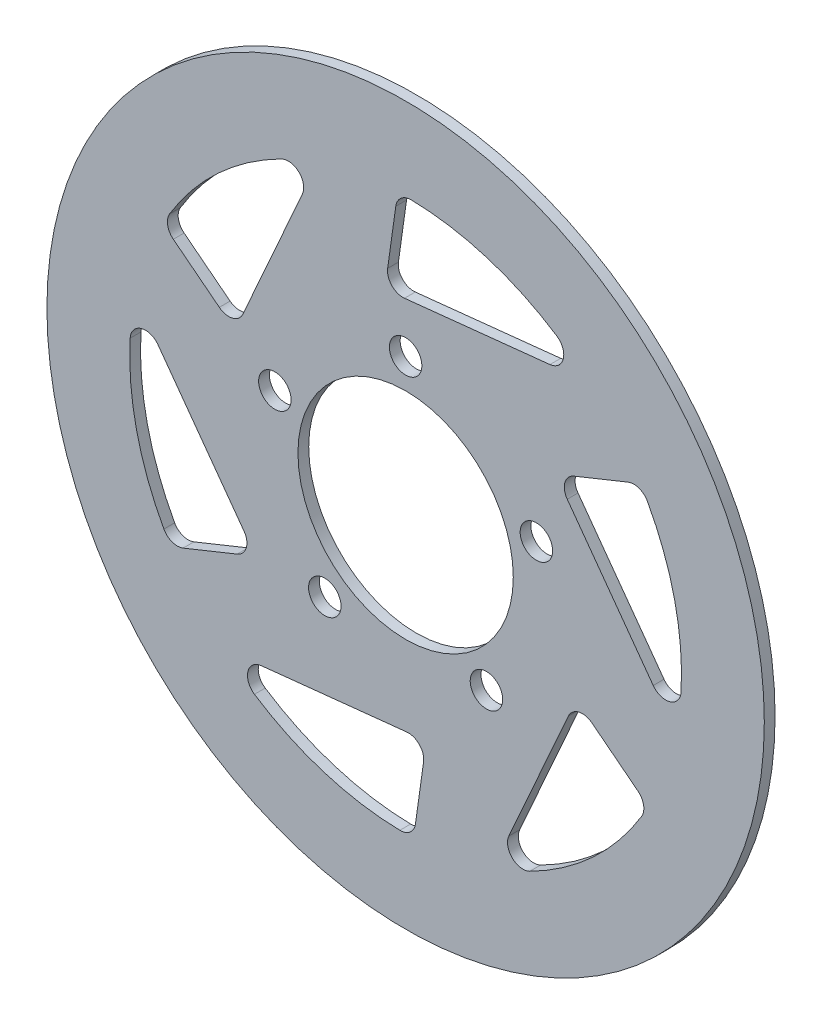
ISO-10303-21;
HEADER;
FILE_DESCRIPTION(('STEP AP214'),'2;1');
FILE_NAME('part.step','',(''),(''),'','','');
FILE_SCHEMA(('AUTOMOTIVE_DESIGN { 1 0 10303 214 1 1 1 1 }'));
ENDSEC;
DATA;
#1=APPLICATION_CONTEXT('core data for automotive mechanical design processes');
#2=APPLICATION_PROTOCOL_DEFINITION('international standard','automotive_design',2000,#1);
#3=PRODUCT_CONTEXT('',#1,'mechanical');
#4=PRODUCT('Part','Part','',(#3));
#5=PRODUCT_RELATED_PRODUCT_CATEGORY('part','',(#4));
#6=PRODUCT_DEFINITION_FORMATION('','',#4);
#7=PRODUCT_DEFINITION_CONTEXT('part definition',#1,'design');
#8=PRODUCT_DEFINITION('design','',#6,#7);
#9=PRODUCT_DEFINITION_SHAPE('','',#8);
#10=(LENGTH_UNIT() NAMED_UNIT(*) SI_UNIT(.MILLI.,.METRE.));
#11=(NAMED_UNIT(*) PLANE_ANGLE_UNIT() SI_UNIT($,.RADIAN.));
#12=(NAMED_UNIT(*) SI_UNIT($,.STERADIAN.) SOLID_ANGLE_UNIT());
#13=UNCERTAINTY_MEASURE_WITH_UNIT(LENGTH_MEASURE(1.E-05),#10,'distance_accuracy_value','');
#14=(GEOMETRIC_REPRESENTATION_CONTEXT(3) GLOBAL_UNCERTAINTY_ASSIGNED_CONTEXT((#13)) GLOBAL_UNIT_ASSIGNED_CONTEXT((#10,
#11,#12)) REPRESENTATION_CONTEXT('',''));
#15=CARTESIAN_POINT('',(0.,0.,0.));
#16=DIRECTION('',(0.,0.,1.));
#17=DIRECTION('',(1.,0.,0.));
#18=AXIS2_PLACEMENT_3D('',#15,#16,#17);
#19=CARTESIAN_POINT('',(0.,0.,1.651));
#20=DIRECTION('',(0.,0.,1.));
#21=DIRECTION('',(1.,0.,0.));
#22=AXIS2_PLACEMENT_3D('',#19,#20,#21);
#23=PLANE('',#22);
#24=CARTESIAN_POINT('',(0.,0.,1.651));
#25=DIRECTION('',(0.,0.,1.));
#26=DIRECTION('',(-0.499999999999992,0.866025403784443,0.));
#27=AXIS2_PLACEMENT_3D('',#24,#25,#26);
#28=CIRCLE('',#27,42.3);
#29=CARTESIAN_POINT('',(-42.2328226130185,2.3830010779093,1.651));
#30=VERTEX_POINT('',#29);
#31=CARTESIAN_POINT('',(-37.0650211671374,-20.3831843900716,1.651));
#32=VERTEX_POINT('',#31);
#33=EDGE_CURVE('E319',#30,#32,#28,.T.);
#34=ORIENTED_EDGE('',*,*,#33,.F.);
#35=CARTESIAN_POINT('',(-39.8743740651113,2.2499248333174,1.651));
#36=DIRECTION('',(0.,0.,1.));
#37=DIRECTION('',(0.499999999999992,-0.866025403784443,0.));
#38=AXIS2_PLACEMENT_3D('',#35,#36,#37);
#39=CIRCLE('',#38,2.3622);
#40=CARTESIAN_POINT('',(-37.9633141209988,3.63839115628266,1.651));
#41=VERTEX_POINT('',#40);
#42=EDGE_CURVE('E317',#41,#30,#39,.T.);
#43=ORIENTED_EDGE('',*,*,#42,.F.);
#44=DIRECTION('',(-0.587785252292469,0.80901699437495,0.));
#45=VECTOR('',#44,1.);
#46=CARTESIAN_POINT('',(-37.9633141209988,3.63839115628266,1.651));
#47=LINE('',#46,#45);
#48=CARTESIAN_POINT('',(-24.7831001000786,-14.5026171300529,1.651));
#49=VERTEX_POINT('',#48);
#50=EDGE_CURVE('E329',#49,#41,#47,.T.);
#51=ORIENTED_EDGE('',*,*,#50,.F.);
#52=CARTESIAN_POINT('',(-26.6941600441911,-15.8910834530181,1.651));
#53=DIRECTION('',(0.,0.,1.));
#54=DIRECTION('',(-0.499999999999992,0.866025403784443,0.));
#55=AXIS2_PLACEMENT_3D('',#52,#53,#54);
#56=CIRCLE('',#55,2.3622);
#57=CARTESIAN_POINT('',(-25.809264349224,-18.0812771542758,1.651));
#58=VERTEX_POINT('',#57);
#59=EDGE_CURVE('E326',#58,#49,#56,.T.);
#60=ORIENTED_EDGE('',*,*,#59,.F.);
#61=DIRECTION('',(0.927183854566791,0.374606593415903,0.));
#62=VECTOR('',#61,1.);
#63=CARTESIAN_POINT('',(-25.809264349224,-18.0812771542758,1.651));
#64=LINE('',#63,#62);
#65=CARTESIAN_POINT('',(-34.1102674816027,-21.4351001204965,1.651));
#66=VERTEX_POINT('',#65);
#67=EDGE_CURVE('E324',#66,#58,#64,.T.);
#68=ORIENTED_EDGE('',*,*,#67,.F.);
#69=CARTESIAN_POINT('',(-34.9951631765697,-19.2449064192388,1.651));
#70=DIRECTION('',(0.,0.,1.));
#71=DIRECTION('',(0.499999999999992,-0.866025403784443,0.));
#72=AXIS2_PLACEMENT_3D('',#69,#70,#71);
#73=CIRCLE('',#72,2.36220000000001);
#74=EDGE_CURVE('E322',#32,#66,#73,.T.);
#75=ORIENTED_EDGE('',*,*,#74,.F.);
#76=EDGE_LOOP('',(#34,#43,#51,#60,#68,#75));
#77=FACE_BOUND('',#76,.T.);
#78=CARTESIAN_POINT('',(0.,0.,1.651));
#79=DIRECTION('',(0.,0.,1.));
#80=DIRECTION('',(-0.500000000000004,-0.866025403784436,0.));
#81=AXIS2_PLACEMENT_3D('',#78,#79,#80);
#82=CIRCLE('',#81,42.3);
#83=CARTESIAN_POINT('',(19.0526718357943,-37.7661977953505,1.651));
#84=VERTEX_POINT('',#83);
#85=CARTESIAN_POINT('',(36.1848660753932,-21.907657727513,1.651));
#86=VERTEX_POINT('',#85);
#87=EDGE_CURVE('E409',#84,#86,#82,.T.);
#88=ORIENTED_EDGE('',*,*,#87,.F.);
#89=CARTESIAN_POINT('',(17.9886949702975,-35.6571833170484,1.651));
#90=DIRECTION('',(0.,0.,1.));
#91=DIRECTION('',(0.500000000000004,0.866025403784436,0.));
#92=AXIS2_PLACEMENT_3D('',#89,#90,#91);
#93=CIRCLE('',#92,2.3622);
#94=CARTESIAN_POINT('',(15.8307178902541,-34.6963900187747,1.651));
#95=VERTEX_POINT('',#94);
#96=EDGE_CURVE('E407',#95,#84,#93,.T.);
#97=ORIENTED_EDGE('',*,*,#96,.F.);
#98=DIRECTION('',(-0.406736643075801,-0.913545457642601,0.));
#99=VECTOR('',#98,1.);
#100=CARTESIAN_POINT('',(15.8307178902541,-34.6963900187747,1.651));
#101=LINE('',#100,#99);
#102=CARTESIAN_POINT('',(24.9511849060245,-14.2114857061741,1.651));
#103=VERTEX_POINT('',#102);
#104=EDGE_CURVE('E419',#103,#95,#101,.T.);
#105=ORIENTED_EDGE('',*,*,#104,.F.);
#106=CARTESIAN_POINT('',(27.1091619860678,-15.1722790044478,1.651));
#107=DIRECTION('',(0.,0.,1.));
#108=DIRECTION('',(-0.500000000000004,-0.866025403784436,0.));
#109=AXIS2_PLACEMENT_3D('',#106,#107,#108);
#110=CIRCLE('',#109,2.3622);
#111=CARTESIAN_POINT('',(28.5634775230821,-13.310840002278,1.651));
#112=VERTEX_POINT('',#111);
#113=EDGE_CURVE('E416',#112,#103,#110,.T.);
#114=ORIENTED_EDGE('',*,*,#113,.F.);
#115=DIRECTION('',(-0.788010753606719,0.615661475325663,0.));
#116=VECTOR('',#115,1.);
#117=CARTESIAN_POINT('',(28.5634775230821,-13.310840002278,1.651));
#118=LINE('',#117,#116);
#119=CARTESIAN_POINT('',(35.6184749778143,-18.8228081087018,1.651));
#120=VERTEX_POINT('',#119);
#121=EDGE_CURVE('E414',#120,#112,#118,.T.);
#122=ORIENTED_EDGE('',*,*,#121,.F.);
#123=CARTESIAN_POINT('',(34.1641594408,-20.6842471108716,1.651));
#124=DIRECTION('',(0.,0.,1.));
#125=DIRECTION('',(0.500000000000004,0.866025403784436,0.));
#126=AXIS2_PLACEMENT_3D('',#123,#124,#125);
#127=CIRCLE('',#126,2.36220000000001);
#128=EDGE_CURVE('E412',#86,#120,#127,.T.);
#129=ORIENTED_EDGE('',*,*,#128,.F.);
#130=EDGE_LOOP('',(#88,#97,#105,#114,#122,#129));
#131=FACE_BOUND('',#130,.T.);
#132=CARTESIAN_POINT('',(0.,0.,1.651));
#133=DIRECTION('',(0.,0.,1.));
#134=DIRECTION('',(1.,0.,0.));
#135=AXIS2_PLACEMENT_3D('',#132,#133,#134);
#136=CIRCLE('',#135,42.3);
#137=CARTESIAN_POINT('',(23.1801507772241,35.3831967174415,1.651));
#138=VERTEX_POINT('',#137);
#139=CARTESIAN_POINT('',(0.880155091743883,42.2908421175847,1.651));
#140=VERTEX_POINT('',#139);
#141=EDGE_CURVE('E499',#138,#140,#136,.T.);
#142=ORIENTED_EDGE('',*,*,#141,.F.);
#143=CARTESIAN_POINT('',(21.8856790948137,33.4072584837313,1.651));
#144=DIRECTION('',(0.,0.,1.));
#145=DIRECTION('',(-1.,0.,0.));
#146=AXIS2_PLACEMENT_3D('',#143,#144,#145);
#147=CIRCLE('',#146,2.3622);
#148=CARTESIAN_POINT('',(22.1325962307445,31.0579988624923,1.651));
#149=VERTEX_POINT('',#148);
#150=EDGE_CURVE('E497',#149,#138,#147,.T.);
#151=ORIENTED_EDGE('',*,*,#150,.F.);
#152=DIRECTION('',(0.994521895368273,0.104528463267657,0.));
#153=VECTOR('',#152,1.);
#154=CARTESIAN_POINT('',(22.1325962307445,31.0579988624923,1.651));
#155=LINE('',#154,#153);
#156=CARTESIAN_POINT('',(-0.168084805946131,28.7141028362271,1.651));
#157=VERTEX_POINT('',#156);
#158=EDGE_CURVE('E509',#157,#149,#155,.T.);
#159=ORIENTED_EDGE('',*,*,#158,.F.);
#160=CARTESIAN_POINT('',(-0.415001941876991,31.0633624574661,1.651));
#161=DIRECTION('',(0.,0.,1.));
#162=DIRECTION('',(1.,0.,0.));
#163=AXIS2_PLACEMENT_3D('',#160,#161,#162);
#164=CIRCLE('',#163,2.3622);
#165=CARTESIAN_POINT('',(-2.75421317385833,31.3921171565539,1.651));
#166=VERTEX_POINT('',#165);
#167=EDGE_CURVE('E506',#166,#157,#164,.T.);
#168=ORIENTED_EDGE('',*,*,#167,.F.);
#169=DIRECTION('',(-0.139173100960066,-0.99026806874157,0.));
#170=VECTOR('',#169,1.);
#171=CARTESIAN_POINT('',(-2.75421317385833,31.3921171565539,1.651));
#172=LINE('',#171,#170);
#173=CARTESIAN_POINT('',(-1.50820749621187,40.2579082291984,1.651));
#174=VERTEX_POINT('',#173);
#175=EDGE_CURVE('E504',#174,#166,#172,.T.);
#176=ORIENTED_EDGE('',*,*,#175,.F.);
#177=CARTESIAN_POINT('',(0.831003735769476,39.9291535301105,1.651));
#178=DIRECTION('',(0.,0.,1.));
#179=DIRECTION('',(-1.,0.,0.));
#180=AXIS2_PLACEMENT_3D('',#177,#178,#179);
#181=CIRCLE('',#180,2.36220000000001);
#182=EDGE_CURVE('E502',#140,#174,#181,.T.);
#183=ORIENTED_EDGE('',*,*,#182,.F.);
#184=EDGE_LOOP('',(#142,#151,#159,#168,#176,#183));
#185=FACE_BOUND('',#184,.T.);
#186=CARTESIAN_POINT('',(-12.3916886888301,-17.0556962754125,1.651));
#187=DIRECTION('',(0.,0.,1.));
#188=DIRECTION('',(-0.809016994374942,0.58778525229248,0.));
#189=AXIS2_PLACEMENT_3D('',#186,#187,#188);
#190=CIRCLE('',#189,2.4892);
#191=CARTESIAN_POINT('',(-14.8808886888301,-17.0556962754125,1.651));
#192=VERTEX_POINT('',#191);
#193=EDGE_CURVE('E548',#192,#192,#190,.T.);
#194=ORIENTED_EDGE('',*,*,#193,.F.);
#195=EDGE_LOOP('',(#194));
#196=FACE_BOUND('',#195,.T.);
#197=CARTESIAN_POINT('',(20.0501734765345,6.51469627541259,1.651));
#198=DIRECTION('',(0.,0.,1.));
#199=DIRECTION('',(0.309016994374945,-0.951056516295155,0.));
#200=AXIS2_PLACEMENT_3D('',#197,#198,#199);
#201=CIRCLE('',#200,2.4892);
#202=CARTESIAN_POINT('',(17.5609734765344,6.51469627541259,1.651));
#203=VERTEX_POINT('',#202);
#204=EDGE_CURVE('E560',#203,#203,#201,.T.);
#205=ORIENTED_EDGE('',*,*,#204,.F.);
#206=EDGE_LOOP('',(#205));
#207=FACE_BOUND('',#206,.T.);
#208=CARTESIAN_POINT('',(0.,0.,1.651));
#209=DIRECTION('',(0.,0.,1.));
#210=DIRECTION('',(1.,0.,0.));
#211=AXIS2_PLACEMENT_3D('',#208,#209,#210);
#212=CIRCLE('',#211,16.51);
#213=CARTESIAN_POINT('',(-16.51,0.,1.651));
#214=VERTEX_POINT('',#213);
#215=EDGE_CURVE('E572',#214,#214,#212,.T.);
#216=ORIENTED_EDGE('',*,*,#215,.F.);
#217=EDGE_LOOP('',(#216));
#218=FACE_BOUND('',#217,.T.);
#219=CARTESIAN_POINT('',(0.,0.,1.651));
#220=DIRECTION('',(0.,0.,1.));
#221=DIRECTION('',(1.,0.,0.));
#222=AXIS2_PLACEMENT_3D('',#219,#220,#221);
#223=CIRCLE('',#222,55.);
#224=CARTESIAN_POINT('',(-55.,0.,1.651));
#225=VERTEX_POINT('',#224);
#226=EDGE_CURVE('E11',#225,#225,#223,.T.);
#227=ORIENTED_EDGE('',*,*,#226,.T.);
#228=EDGE_LOOP('',(#227));
#229=FACE_BOUND('',#228,.T.);
#230=CARTESIAN_POINT('',(0.,21.082,1.651));
#231=DIRECTION('',(0.,0.,1.));
#232=DIRECTION('',(1.,0.,0.));
#233=AXIS2_PLACEMENT_3D('',#230,#231,#232);
#234=CIRCLE('',#233,2.4892);
#235=CARTESIAN_POINT('',(-2.4892,21.082,1.651));
#236=VERTEX_POINT('',#235);
#237=EDGE_CURVE('E566',#236,#236,#234,.T.);
#238=ORIENTED_EDGE('',*,*,#237,.F.);
#239=EDGE_LOOP('',(#238));
#240=FACE_BOUND('',#239,.T.);
#241=CARTESIAN_POINT('',(12.3916886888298,-17.0556962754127,1.651));
#242=DIRECTION('',(0.,0.,1.));
#243=DIRECTION('',(-0.809016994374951,-0.587785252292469,0.));
#244=AXIS2_PLACEMENT_3D('',#241,#242,#243);
#245=CIRCLE('',#244,2.4892);
#246=CARTESIAN_POINT('',(9.90248868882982,-17.0556962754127,1.651));
#247=VERTEX_POINT('',#246);
#248=EDGE_CURVE('E554',#247,#247,#245,.T.);
#249=ORIENTED_EDGE('',*,*,#248,.F.);
#250=EDGE_LOOP('',(#249));
#251=FACE_BOUND('',#250,.T.);
#252=CARTESIAN_POINT('',(-20.0501734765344,6.51469627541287,1.651));
#253=DIRECTION('',(0.,0.,1.));
#254=DIRECTION('',(0.309016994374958,0.95105651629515,0.));
#255=AXIS2_PLACEMENT_3D('',#252,#253,#254);
#256=CIRCLE('',#255,2.4892);
#257=CARTESIAN_POINT('',(-22.5393734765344,6.51469627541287,1.651));
#258=VERTEX_POINT('',#257);
#259=EDGE_CURVE('E542',#258,#258,#256,.T.);
#260=ORIENTED_EDGE('',*,*,#259,.F.);
#261=EDGE_LOOP('',(#260));
#262=FACE_BOUND('',#261,.T.);
#263=CARTESIAN_POINT('',(0.,0.,1.651));
#264=DIRECTION('',(0.,0.,1.));
#265=DIRECTION('',(0.499999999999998,-0.86602540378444,0.));
#266=AXIS2_PLACEMENT_3D('',#263,#264,#265);
#267=CIRCLE('',#266,42.3);
#268=CARTESIAN_POINT('',(42.2328226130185,-2.383001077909,1.651));
#269=VERTEX_POINT('',#268);
#270=CARTESIAN_POINT('',(37.0650211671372,20.3831843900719,1.651));
#271=VERTEX_POINT('',#270);
#272=EDGE_CURVE('E454',#269,#271,#267,.T.);
#273=ORIENTED_EDGE('',*,*,#272,.F.);
#274=CARTESIAN_POINT('',(39.8743740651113,-2.24992483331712,1.651));
#275=DIRECTION('',(0.,0.,1.));
#276=DIRECTION('',(-0.499999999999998,0.86602540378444,0.));
#277=AXIS2_PLACEMENT_3D('',#274,#275,#276);
#278=CIRCLE('',#277,2.3622);
#279=CARTESIAN_POINT('',(37.9633141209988,-3.6383911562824,1.651));
#280=VERTEX_POINT('',#279);
#281=EDGE_CURVE('E452',#280,#269,#278,.T.);
#282=ORIENTED_EDGE('',*,*,#281,.F.);
#283=DIRECTION('',(0.587785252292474,-0.809016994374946,0.));
#284=VECTOR('',#283,1.);
#285=CARTESIAN_POINT('',(37.9633141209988,-3.6383911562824,1.651));
#286=LINE('',#285,#284);
#287=CARTESIAN_POINT('',(24.7831001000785,14.502617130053,1.651));
#288=VERTEX_POINT('',#287);
#289=EDGE_CURVE('E464',#288,#280,#286,.T.);
#290=ORIENTED_EDGE('',*,*,#289,.F.);
#291=CARTESIAN_POINT('',(26.694160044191,15.8910834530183,1.651));
#292=DIRECTION('',(0.,0.,1.));
#293=DIRECTION('',(0.499999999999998,-0.86602540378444,0.));
#294=AXIS2_PLACEMENT_3D('',#291,#292,#293);
#295=CIRCLE('',#294,2.3622);
#296=CARTESIAN_POINT('',(25.8092643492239,18.081277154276,1.651));
#297=VERTEX_POINT('',#296);
#298=EDGE_CURVE('E461',#297,#288,#295,.T.);
#299=ORIENTED_EDGE('',*,*,#298,.F.);
#300=DIRECTION('',(-0.927183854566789,-0.374606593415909,0.));
#301=VECTOR('',#300,1.);
#302=CARTESIAN_POINT('',(25.8092643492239,18.081277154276,1.651));
#303=LINE('',#302,#301);
#304=CARTESIAN_POINT('',(34.1102674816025,21.4351001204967,1.651));
#305=VERTEX_POINT('',#304);
#306=EDGE_CURVE('E459',#305,#297,#303,.T.);
#307=ORIENTED_EDGE('',*,*,#306,.F.);
#308=CARTESIAN_POINT('',(34.9951631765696,19.244906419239,1.651));
#309=DIRECTION('',(0.,0.,1.));
#310=DIRECTION('',(-0.499999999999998,0.86602540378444,0.));
#311=AXIS2_PLACEMENT_3D('',#308,#309,#310);
#312=CIRCLE('',#311,2.36220000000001);
#313=EDGE_CURVE('E457',#271,#305,#312,.T.);
#314=ORIENTED_EDGE('',*,*,#313,.F.);
#315=EDGE_LOOP('',(#273,#282,#290,#299,#307,#314));
#316=FACE_BOUND('',#315,.T.);
#317=CARTESIAN_POINT('',(0.,0.,1.651));
#318=DIRECTION('',(0.,0.,1.));
#319=DIRECTION('',(-1.,0.,0.));
#320=AXIS2_PLACEMENT_3D('',#317,#318,#319);
#321=CIRCLE('',#320,42.3);
#322=CARTESIAN_POINT('',(-23.1801507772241,-35.3831967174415,1.651));
#323=VERTEX_POINT('',#322);
#324=CARTESIAN_POINT('',(-0.880155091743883,-42.2908421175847,1.651));
#325=VERTEX_POINT('',#324);
#326=EDGE_CURVE('E364',#323,#325,#321,.T.);
#327=ORIENTED_EDGE('',*,*,#326,.F.);
#328=CARTESIAN_POINT('',(-21.8856790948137,-33.4072584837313,1.651));
#329=DIRECTION('',(0.,0.,1.));
#330=DIRECTION('',(1.,0.,0.));
#331=AXIS2_PLACEMENT_3D('',#328,#329,#330);
#332=CIRCLE('',#331,2.3622);
#333=CARTESIAN_POINT('',(-22.1325962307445,-31.0579988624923,1.651));
#334=VERTEX_POINT('',#333);
#335=EDGE_CURVE('E362',#334,#323,#332,.T.);
#336=ORIENTED_EDGE('',*,*,#335,.F.);
#337=DIRECTION('',(-0.994521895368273,-0.104528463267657,0.));
#338=VECTOR('',#337,1.);
#339=CARTESIAN_POINT('',(-22.1325962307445,-31.0579988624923,1.651));
#340=LINE('',#339,#338);
#341=CARTESIAN_POINT('',(0.168084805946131,-28.7141028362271,1.651));
#342=VERTEX_POINT('',#341);
#343=EDGE_CURVE('E374',#342,#334,#340,.T.);
#344=ORIENTED_EDGE('',*,*,#343,.F.);
#345=CARTESIAN_POINT('',(0.415001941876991,-31.0633624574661,1.651));
#346=DIRECTION('',(0.,0.,1.));
#347=DIRECTION('',(-1.,0.,0.));
#348=AXIS2_PLACEMENT_3D('',#345,#346,#347);
#349=CIRCLE('',#348,2.3622);
#350=CARTESIAN_POINT('',(2.75421317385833,-31.3921171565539,1.651));
#351=VERTEX_POINT('',#350);
#352=EDGE_CURVE('E371',#351,#342,#349,.T.);
#353=ORIENTED_EDGE('',*,*,#352,.F.);
#354=DIRECTION('',(0.139173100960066,0.99026806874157,0.));
#355=VECTOR('',#354,1.);
#356=CARTESIAN_POINT('',(2.75421317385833,-31.3921171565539,1.651));
#357=LINE('',#356,#355);
#358=CARTESIAN_POINT('',(1.50820749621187,-40.2579082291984,1.651));
#359=VERTEX_POINT('',#358);
#360=EDGE_CURVE('E369',#359,#351,#357,.T.);
#361=ORIENTED_EDGE('',*,*,#360,.F.);
#362=CARTESIAN_POINT('',(-0.831003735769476,-39.9291535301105,1.651));
#363=DIRECTION('',(0.,0.,1.));
#364=DIRECTION('',(1.,0.,0.));
#365=AXIS2_PLACEMENT_3D('',#362,#363,#364);
#366=CIRCLE('',#365,2.36220000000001);
#367=EDGE_CURVE('E367',#325,#359,#366,.T.);
#368=ORIENTED_EDGE('',*,*,#367,.F.);
#369=EDGE_LOOP('',(#327,#336,#344,#353,#361,#368));
#370=FACE_BOUND('',#369,.T.);
#371=CARTESIAN_POINT('',(0.,0.,1.651));
#372=DIRECTION('',(0.,0.,1.));
#373=DIRECTION('',(0.50000000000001,0.866025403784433,0.));
#374=AXIS2_PLACEMENT_3D('',#371,#372,#373);
#375=CIRCLE('',#374,42.3);
#376=CARTESIAN_POINT('',(-19.052671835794,37.7661977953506,1.651));
#377=VERTEX_POINT('',#376);
#378=CARTESIAN_POINT('',(-36.1848660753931,21.9076577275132,1.651));
#379=VERTEX_POINT('',#378);
#380=EDGE_CURVE('E274',#377,#379,#375,.T.);
#381=ORIENTED_EDGE('',*,*,#380,.F.);
#382=CARTESIAN_POINT('',(-17.9886949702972,35.6571833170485,1.651));
#383=DIRECTION('',(0.,0.,1.));
#384=DIRECTION('',(-0.50000000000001,-0.866025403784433,0.));
#385=AXIS2_PLACEMENT_3D('',#382,#383,#384);
#386=CIRCLE('',#385,2.3622);
#387=CARTESIAN_POINT('',(-15.8307178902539,34.6963900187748,1.651));
#388=VERTEX_POINT('',#387);
#389=EDGE_CURVE('E266',#388,#377,#386,.T.);
#390=ORIENTED_EDGE('',*,*,#389,.F.);
#391=DIRECTION('',(0.406736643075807,0.913545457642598,0.));
#392=VECTOR('',#391,1.);
#393=CARTESIAN_POINT('',(-15.8307178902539,34.6963900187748,1.651));
#394=LINE('',#393,#392);
#395=CARTESIAN_POINT('',(-24.9511849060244,14.2114857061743,1.651));
#396=VERTEX_POINT('',#395);
#397=EDGE_CURVE('E295',#396,#388,#394,.T.);
#398=ORIENTED_EDGE('',*,*,#397,.F.);
#399=CARTESIAN_POINT('',(-27.1091619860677,15.172279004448,1.651));
#400=DIRECTION('',(0.,0.,1.));
#401=DIRECTION('',(0.50000000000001,0.866025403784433,0.));
#402=AXIS2_PLACEMENT_3D('',#399,#400,#401);
#403=CIRCLE('',#402,2.3622);
#404=CARTESIAN_POINT('',(-28.563477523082,13.3108400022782,1.651));
#405=VERTEX_POINT('',#404);
#406=EDGE_CURVE('E293',#405,#396,#403,.T.);
#407=ORIENTED_EDGE('',*,*,#406,.F.);
#408=DIRECTION('',(0.788010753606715,-0.615661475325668,0.));
#409=VECTOR('',#408,1.);
#410=CARTESIAN_POINT('',(-28.563477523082,13.3108400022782,1.651));
#411=LINE('',#410,#409);
#412=CARTESIAN_POINT('',(-35.6184749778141,18.822808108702,1.651));
#413=VERTEX_POINT('',#412);
#414=EDGE_CURVE('E289',#413,#405,#411,.T.);
#415=ORIENTED_EDGE('',*,*,#414,.F.);
#416=CARTESIAN_POINT('',(-34.1641594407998,20.6842471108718,1.651));
#417=DIRECTION('',(0.,0.,1.));
#418=DIRECTION('',(-0.50000000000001,-0.866025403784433,0.));
#419=AXIS2_PLACEMENT_3D('',#416,#417,#418);
#420=CIRCLE('',#419,2.36220000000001);
#421=EDGE_CURVE('E287',#379,#413,#420,.T.);
#422=ORIENTED_EDGE('',*,*,#421,.F.);
#423=EDGE_LOOP('',(#381,#390,#398,#407,#415,#422));
#424=FACE_BOUND('',#423,.T.);
#425=ADVANCED_FACE('F33',(#77,#131,#185,#196,#207,#218,#229,#240,#251,#262,#316,#370,#424),#23,.T.);
#426=CARTESIAN_POINT('',(0.,0.,0.));
#427=DIRECTION('',(0.,0.,1.));
#428=DIRECTION('',(1.,0.,0.));
#429=AXIS2_PLACEMENT_3D('',#426,#427,#428);
#430=PLANE('',#429);
#431=CARTESIAN_POINT('',(-39.8743740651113,2.2499248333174,0.));
#432=DIRECTION('',(0.,0.,1.));
#433=DIRECTION('',(0.499999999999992,-0.866025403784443,0.));
#434=AXIS2_PLACEMENT_3D('',#431,#432,#433);
#435=CIRCLE('',#434,2.3622);
#436=CARTESIAN_POINT('',(-37.9633141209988,3.63839115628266,0.));
#437=VERTEX_POINT('',#436);
#438=CARTESIAN_POINT('',(-42.2328226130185,2.3830010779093,0.));
#439=VERTEX_POINT('',#438);
#440=EDGE_CURVE('E282',#437,#439,#435,.T.);
#441=ORIENTED_EDGE('',*,*,#440,.T.);
#442=CARTESIAN_POINT('',(0.,0.,0.));
#443=DIRECTION('',(0.,0.,1.));
#444=DIRECTION('',(-0.499999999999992,0.866025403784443,0.));
#445=AXIS2_PLACEMENT_3D('',#442,#443,#444);
#446=CIRCLE('',#445,42.3);
#447=CARTESIAN_POINT('',(-37.0650211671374,-20.3831843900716,0.));
#448=VERTEX_POINT('',#447);
#449=EDGE_CURVE('E334',#439,#448,#446,.T.);
#450=ORIENTED_EDGE('',*,*,#449,.T.);
#451=CARTESIAN_POINT('',(-34.9951631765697,-19.2449064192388,0.));
#452=DIRECTION('',(0.,0.,1.));
#453=DIRECTION('',(0.499999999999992,-0.866025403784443,0.));
#454=AXIS2_PLACEMENT_3D('',#451,#452,#453);
#455=CIRCLE('',#454,2.36220000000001);
#456=CARTESIAN_POINT('',(-34.1102674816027,-21.4351001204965,0.));
#457=VERTEX_POINT('',#456);
#458=EDGE_CURVE('E337',#448,#457,#455,.T.);
#459=ORIENTED_EDGE('',*,*,#458,.T.);
#460=DIRECTION('',(0.927183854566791,0.374606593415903,0.));
#461=VECTOR('',#460,1.);
#462=CARTESIAN_POINT('',(-25.809264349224,-18.0812771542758,0.));
#463=LINE('',#462,#461);
#464=CARTESIAN_POINT('',(-25.809264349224,-18.0812771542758,0.));
#465=VERTEX_POINT('',#464);
#466=EDGE_CURVE('E340',#457,#465,#463,.T.);
#467=ORIENTED_EDGE('',*,*,#466,.T.);
#468=CARTESIAN_POINT('',(-26.6941600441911,-15.8910834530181,0.));
#469=DIRECTION('',(0.,0.,1.));
#470=DIRECTION('',(-0.499999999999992,0.866025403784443,0.));
#471=AXIS2_PLACEMENT_3D('',#468,#469,#470);
#472=CIRCLE('',#471,2.3622);
#473=CARTESIAN_POINT('',(-24.7831001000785,-14.5026171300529,0.));
#474=VERTEX_POINT('',#473);
#475=EDGE_CURVE('E343',#465,#474,#472,.T.);
#476=ORIENTED_EDGE('',*,*,#475,.T.);
#477=DIRECTION('',(-0.587785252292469,0.80901699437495,0.));
#478=VECTOR('',#477,1.);
#479=CARTESIAN_POINT('',(-37.9633141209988,3.63839115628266,0.));
#480=LINE('',#479,#478);
#481=EDGE_CURVE('E320',#474,#437,#480,.T.);
#482=ORIENTED_EDGE('',*,*,#481,.T.);
#483=EDGE_LOOP('',(#441,#450,#459,#467,#476,#482));
#484=FACE_BOUND('',#483,.T.);
#485=CARTESIAN_POINT('',(17.9886949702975,-35.6571833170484,0.));
#486=DIRECTION('',(0.,0.,1.));
#487=DIRECTION('',(0.500000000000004,0.866025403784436,0.));
#488=AXIS2_PLACEMENT_3D('',#485,#486,#487);
#489=CIRCLE('',#488,2.3622);
#490=CARTESIAN_POINT('',(15.8307178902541,-34.6963900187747,0.));
#491=VERTEX_POINT('',#490);
#492=CARTESIAN_POINT('',(19.0526718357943,-37.7661977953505,0.));
#493=VERTEX_POINT('',#492);
#494=EDGE_CURVE('E406',#491,#493,#489,.T.);
#495=ORIENTED_EDGE('',*,*,#494,.T.);
#496=CARTESIAN_POINT('',(0.,0.,0.));
#497=DIRECTION('',(0.,0.,1.));
#498=DIRECTION('',(-0.500000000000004,-0.866025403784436,0.));
#499=AXIS2_PLACEMENT_3D('',#496,#497,#498);
#500=CIRCLE('',#499,42.3);
#501=CARTESIAN_POINT('',(36.1848660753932,-21.907657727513,0.));
#502=VERTEX_POINT('',#501);
#503=EDGE_CURVE('E424',#493,#502,#500,.T.);
#504=ORIENTED_EDGE('',*,*,#503,.T.);
#505=CARTESIAN_POINT('',(34.1641594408,-20.6842471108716,0.));
#506=DIRECTION('',(0.,0.,1.));
#507=DIRECTION('',(0.500000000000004,0.866025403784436,0.));
#508=AXIS2_PLACEMENT_3D('',#505,#506,#507);
#509=CIRCLE('',#508,2.36220000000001);
#510=CARTESIAN_POINT('',(35.6184749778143,-18.8228081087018,0.));
#511=VERTEX_POINT('',#510);
#512=EDGE_CURVE('E427',#502,#511,#509,.T.);
#513=ORIENTED_EDGE('',*,*,#512,.T.);
#514=DIRECTION('',(-0.788010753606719,0.615661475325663,0.));
#515=VECTOR('',#514,1.);
#516=CARTESIAN_POINT('',(28.5634775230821,-13.310840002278,0.));
#517=LINE('',#516,#515);
#518=CARTESIAN_POINT('',(28.5634775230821,-13.310840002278,0.));
#519=VERTEX_POINT('',#518);
#520=EDGE_CURVE('E430',#511,#519,#517,.T.);
#521=ORIENTED_EDGE('',*,*,#520,.T.);
#522=CARTESIAN_POINT('',(27.1091619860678,-15.1722790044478,0.));
#523=DIRECTION('',(0.,0.,1.));
#524=DIRECTION('',(-0.500000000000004,-0.866025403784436,0.));
#525=AXIS2_PLACEMENT_3D('',#522,#523,#524);
#526=CIRCLE('',#525,2.3622);
#527=CARTESIAN_POINT('',(24.9511849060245,-14.2114857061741,0.));
#528=VERTEX_POINT('',#527);
#529=EDGE_CURVE('E433',#519,#528,#526,.T.);
#530=ORIENTED_EDGE('',*,*,#529,.T.);
#531=DIRECTION('',(-0.406736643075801,-0.913545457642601,0.));
#532=VECTOR('',#531,1.);
#533=CARTESIAN_POINT('',(15.8307178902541,-34.6963900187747,0.));
#534=LINE('',#533,#532);
#535=EDGE_CURVE('E410',#528,#491,#534,.T.);
#536=ORIENTED_EDGE('',*,*,#535,.T.);
#537=EDGE_LOOP('',(#495,#504,#513,#521,#530,#536));
#538=FACE_BOUND('',#537,.T.);
#539=CARTESIAN_POINT('',(21.8856790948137,33.4072584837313,0.));
#540=DIRECTION('',(0.,0.,1.));
#541=DIRECTION('',(-1.,0.,0.));
#542=AXIS2_PLACEMENT_3D('',#539,#540,#541);
#543=CIRCLE('',#542,2.3622);
#544=CARTESIAN_POINT('',(22.1325962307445,31.0579988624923,0.));
#545=VERTEX_POINT('',#544);
#546=CARTESIAN_POINT('',(23.1801507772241,35.3831967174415,0.));
#547=VERTEX_POINT('',#546);
#548=EDGE_CURVE('E496',#545,#547,#543,.T.);
#549=ORIENTED_EDGE('',*,*,#548,.T.);
#550=CARTESIAN_POINT('',(0.,0.,0.));
#551=DIRECTION('',(0.,0.,1.));
#552=DIRECTION('',(1.,0.,0.));
#553=AXIS2_PLACEMENT_3D('',#550,#551,#552);
#554=CIRCLE('',#553,42.3);
#555=CARTESIAN_POINT('',(0.880155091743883,42.2908421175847,0.));
#556=VERTEX_POINT('',#555);
#557=EDGE_CURVE('E514',#547,#556,#554,.T.);
#558=ORIENTED_EDGE('',*,*,#557,.T.);
#559=CARTESIAN_POINT('',(0.831003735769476,39.9291535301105,0.));
#560=DIRECTION('',(0.,0.,1.));
#561=DIRECTION('',(-1.,0.,0.));
#562=AXIS2_PLACEMENT_3D('',#559,#560,#561);
#563=CIRCLE('',#562,2.36220000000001);
#564=CARTESIAN_POINT('',(-1.50820749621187,40.2579082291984,0.));
#565=VERTEX_POINT('',#564);
#566=EDGE_CURVE('E517',#556,#565,#563,.T.);
#567=ORIENTED_EDGE('',*,*,#566,.T.);
#568=DIRECTION('',(-0.139173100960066,-0.99026806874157,0.));
#569=VECTOR('',#568,1.);
#570=CARTESIAN_POINT('',(-2.75421317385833,31.3921171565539,0.));
#571=LINE('',#570,#569);
#572=CARTESIAN_POINT('',(-2.75421317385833,31.3921171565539,0.));
#573=VERTEX_POINT('',#572);
#574=EDGE_CURVE('E520',#565,#573,#571,.T.);
#575=ORIENTED_EDGE('',*,*,#574,.T.);
#576=CARTESIAN_POINT('',(-0.415001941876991,31.0633624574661,0.));
#577=DIRECTION('',(0.,0.,1.));
#578=DIRECTION('',(1.,0.,0.));
#579=AXIS2_PLACEMENT_3D('',#576,#577,#578);
#580=CIRCLE('',#579,2.3622);
#581=CARTESIAN_POINT('',(-0.168084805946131,28.7141028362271,0.));
#582=VERTEX_POINT('',#581);
#583=EDGE_CURVE('E523',#573,#582,#580,.T.);
#584=ORIENTED_EDGE('',*,*,#583,.T.);
#585=DIRECTION('',(0.994521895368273,0.104528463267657,0.));
#586=VECTOR('',#585,1.);
#587=CARTESIAN_POINT('',(22.1325962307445,31.0579988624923,0.));
#588=LINE('',#587,#586);
#589=EDGE_CURVE('E500',#582,#545,#588,.T.);
#590=ORIENTED_EDGE('',*,*,#589,.T.);
#591=EDGE_LOOP('',(#549,#558,#567,#575,#584,#590));
#592=FACE_BOUND('',#591,.T.);
#593=CARTESIAN_POINT('',(-12.3916886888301,-17.0556962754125,0.));
#594=DIRECTION('',(0.,0.,1.));
#595=DIRECTION('',(-0.809016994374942,0.58778525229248,0.));
#596=AXIS2_PLACEMENT_3D('',#593,#594,#595);
#597=CIRCLE('',#596,2.4892);
#598=CARTESIAN_POINT('',(-14.8808886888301,-17.0556962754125,0.));
#599=VERTEX_POINT('',#598);
#600=EDGE_CURVE('E545',#599,#599,#597,.T.);
#601=ORIENTED_EDGE('',*,*,#600,.T.);
#602=EDGE_LOOP('',(#601));
#603=FACE_BOUND('',#602,.T.);
#604=CARTESIAN_POINT('',(20.0501734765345,6.51469627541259,0.));
#605=DIRECTION('',(0.,0.,1.));
#606=DIRECTION('',(0.309016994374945,-0.951056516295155,0.));
#607=AXIS2_PLACEMENT_3D('',#604,#605,#606);
#608=CIRCLE('',#607,2.4892);
#609=CARTESIAN_POINT('',(17.5609734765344,6.51469627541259,0.));
#610=VERTEX_POINT('',#609);
#611=EDGE_CURVE('E557',#610,#610,#608,.T.);
#612=ORIENTED_EDGE('',*,*,#611,.T.);
#613=EDGE_LOOP('',(#612));
#614=FACE_BOUND('',#613,.T.);
#615=CARTESIAN_POINT('',(0.,0.,0.));
#616=DIRECTION('',(0.,0.,1.));
#617=DIRECTION('',(1.,0.,0.));
#618=AXIS2_PLACEMENT_3D('',#615,#616,#617);
#619=CIRCLE('',#618,16.51);
#620=CARTESIAN_POINT('',(-16.51,0.,0.));
#621=VERTEX_POINT('',#620);
#622=EDGE_CURVE('E569',#621,#621,#619,.T.);
#623=ORIENTED_EDGE('',*,*,#622,.T.);
#624=EDGE_LOOP('',(#623));
#625=FACE_BOUND('',#624,.T.);
#626=CARTESIAN_POINT('',(0.,0.,0.));
#627=DIRECTION('',(0.,0.,1.));
#628=DIRECTION('',(1.,0.,0.));
#629=AXIS2_PLACEMENT_3D('',#626,#627,#628);
#630=CIRCLE('',#629,55.);
#631=CARTESIAN_POINT('',(-55.,0.,0.));
#632=VERTEX_POINT('',#631);
#633=EDGE_CURVE('E37',#632,#632,#630,.T.);
#634=ORIENTED_EDGE('',*,*,#633,.F.);
#635=EDGE_LOOP('',(#634));
#636=FACE_BOUND('',#635,.T.);
#637=CARTESIAN_POINT('',(0.,21.082,0.));
#638=DIRECTION('',(0.,0.,1.));
#639=DIRECTION('',(1.,0.,0.));
#640=AXIS2_PLACEMENT_3D('',#637,#638,#639);
#641=CIRCLE('',#640,2.4892);
#642=CARTESIAN_POINT('',(-2.4892,21.082,0.));
#643=VERTEX_POINT('',#642);
#644=EDGE_CURVE('E563',#643,#643,#641,.T.);
#645=ORIENTED_EDGE('',*,*,#644,.T.);
#646=EDGE_LOOP('',(#645));
#647=FACE_BOUND('',#646,.T.);
#648=CARTESIAN_POINT('',(12.3916886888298,-17.0556962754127,0.));
#649=DIRECTION('',(0.,0.,1.));
#650=DIRECTION('',(-0.809016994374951,-0.587785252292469,0.));
#651=AXIS2_PLACEMENT_3D('',#648,#649,#650);
#652=CIRCLE('',#651,2.4892);
#653=CARTESIAN_POINT('',(9.90248868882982,-17.0556962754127,0.));
#654=VERTEX_POINT('',#653);
#655=EDGE_CURVE('E551',#654,#654,#652,.T.);
#656=ORIENTED_EDGE('',*,*,#655,.T.);
#657=EDGE_LOOP('',(#656));
#658=FACE_BOUND('',#657,.T.);
#659=CARTESIAN_POINT('',(-20.0501734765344,6.51469627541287,0.));
#660=DIRECTION('',(0.,0.,1.));
#661=DIRECTION('',(0.309016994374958,0.95105651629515,0.));
#662=AXIS2_PLACEMENT_3D('',#659,#660,#661);
#663=CIRCLE('',#662,2.4892);
#664=CARTESIAN_POINT('',(-22.5393734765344,6.51469627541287,0.));
#665=VERTEX_POINT('',#664);
#666=EDGE_CURVE('E541',#665,#665,#663,.T.);
#667=ORIENTED_EDGE('',*,*,#666,.T.);
#668=EDGE_LOOP('',(#667));
#669=FACE_BOUND('',#668,.T.);
#670=CARTESIAN_POINT('',(39.8743740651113,-2.24992483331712,0.));
#671=DIRECTION('',(0.,0.,1.));
#672=DIRECTION('',(-0.499999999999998,0.86602540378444,0.));
#673=AXIS2_PLACEMENT_3D('',#670,#671,#672);
#674=CIRCLE('',#673,2.3622);
#675=CARTESIAN_POINT('',(37.9633141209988,-3.6383911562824,0.));
#676=VERTEX_POINT('',#675);
#677=CARTESIAN_POINT('',(42.2328226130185,-2.383001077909,0.));
#678=VERTEX_POINT('',#677);
#679=EDGE_CURVE('E451',#676,#678,#674,.T.);
#680=ORIENTED_EDGE('',*,*,#679,.T.);
#681=CARTESIAN_POINT('',(0.,0.,0.));
#682=DIRECTION('',(0.,0.,1.));
#683=DIRECTION('',(0.499999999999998,-0.86602540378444,0.));
#684=AXIS2_PLACEMENT_3D('',#681,#682,#683);
#685=CIRCLE('',#684,42.3);
#686=CARTESIAN_POINT('',(37.0650211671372,20.3831843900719,0.));
#687=VERTEX_POINT('',#686);
#688=EDGE_CURVE('E469',#678,#687,#685,.T.);
#689=ORIENTED_EDGE('',*,*,#688,.T.);
#690=CARTESIAN_POINT('',(34.9951631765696,19.244906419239,0.));
#691=DIRECTION('',(0.,0.,1.));
#692=DIRECTION('',(-0.499999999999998,0.86602540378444,0.));
#693=AXIS2_PLACEMENT_3D('',#690,#691,#692);
#694=CIRCLE('',#693,2.36220000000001);
#695=CARTESIAN_POINT('',(34.1102674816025,21.4351001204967,0.));
#696=VERTEX_POINT('',#695);
#697=EDGE_CURVE('E472',#687,#696,#694,.T.);
#698=ORIENTED_EDGE('',*,*,#697,.T.);
#699=DIRECTION('',(-0.927183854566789,-0.374606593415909,0.));
#700=VECTOR('',#699,1.);
#701=CARTESIAN_POINT('',(25.8092643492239,18.081277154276,0.));
#702=LINE('',#701,#700);
#703=CARTESIAN_POINT('',(25.8092643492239,18.081277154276,0.));
#704=VERTEX_POINT('',#703);
#705=EDGE_CURVE('E475',#696,#704,#702,.T.);
#706=ORIENTED_EDGE('',*,*,#705,.T.);
#707=CARTESIAN_POINT('',(26.694160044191,15.8910834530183,0.));
#708=DIRECTION('',(0.,0.,1.));
#709=DIRECTION('',(0.499999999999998,-0.86602540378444,0.));
#710=AXIS2_PLACEMENT_3D('',#707,#708,#709);
#711=CIRCLE('',#710,2.3622);
#712=CARTESIAN_POINT('',(24.7831001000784,14.502617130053,0.));
#713=VERTEX_POINT('',#712);
#714=EDGE_CURVE('E478',#704,#713,#711,.T.);
#715=ORIENTED_EDGE('',*,*,#714,.T.);
#716=DIRECTION('',(0.587785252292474,-0.809016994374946,0.));
#717=VECTOR('',#716,1.);
#718=CARTESIAN_POINT('',(37.9633141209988,-3.6383911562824,0.));
#719=LINE('',#718,#717);
#720=EDGE_CURVE('E455',#713,#676,#719,.T.);
#721=ORIENTED_EDGE('',*,*,#720,.T.);
#722=EDGE_LOOP('',(#680,#689,#698,#706,#715,#721));
#723=FACE_BOUND('',#722,.T.);
#724=CARTESIAN_POINT('',(-21.8856790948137,-33.4072584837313,0.));
#725=DIRECTION('',(0.,0.,1.));
#726=DIRECTION('',(1.,0.,0.));
#727=AXIS2_PLACEMENT_3D('',#724,#725,#726);
#728=CIRCLE('',#727,2.3622);
#729=CARTESIAN_POINT('',(-22.1325962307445,-31.0579988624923,0.));
#730=VERTEX_POINT('',#729);
#731=CARTESIAN_POINT('',(-23.1801507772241,-35.3831967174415,0.));
#732=VERTEX_POINT('',#731);
#733=EDGE_CURVE('E361',#730,#732,#728,.T.);
#734=ORIENTED_EDGE('',*,*,#733,.T.);
#735=CARTESIAN_POINT('',(0.,0.,0.));
#736=DIRECTION('',(0.,0.,1.));
#737=DIRECTION('',(-1.,0.,0.));
#738=AXIS2_PLACEMENT_3D('',#735,#736,#737);
#739=CIRCLE('',#738,42.3);
#740=CARTESIAN_POINT('',(-0.880155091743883,-42.2908421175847,0.));
#741=VERTEX_POINT('',#740);
#742=EDGE_CURVE('E379',#732,#741,#739,.T.);
#743=ORIENTED_EDGE('',*,*,#742,.T.);
#744=CARTESIAN_POINT('',(-0.831003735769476,-39.9291535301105,0.));
#745=DIRECTION('',(0.,0.,1.));
#746=DIRECTION('',(1.,0.,0.));
#747=AXIS2_PLACEMENT_3D('',#744,#745,#746);
#748=CIRCLE('',#747,2.36220000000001);
#749=CARTESIAN_POINT('',(1.50820749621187,-40.2579082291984,0.));
#750=VERTEX_POINT('',#749);
#751=EDGE_CURVE('E382',#741,#750,#748,.T.);
#752=ORIENTED_EDGE('',*,*,#751,.T.);
#753=DIRECTION('',(0.139173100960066,0.99026806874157,0.));
#754=VECTOR('',#753,1.);
#755=CARTESIAN_POINT('',(2.75421317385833,-31.3921171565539,0.));
#756=LINE('',#755,#754);
#757=CARTESIAN_POINT('',(2.75421317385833,-31.3921171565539,0.));
#758=VERTEX_POINT('',#757);
#759=EDGE_CURVE('E385',#750,#758,#756,.T.);
#760=ORIENTED_EDGE('',*,*,#759,.T.);
#761=CARTESIAN_POINT('',(0.415001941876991,-31.0633624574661,0.));
#762=DIRECTION('',(0.,0.,1.));
#763=DIRECTION('',(-1.,0.,0.));
#764=AXIS2_PLACEMENT_3D('',#761,#762,#763);
#765=CIRCLE('',#764,2.3622);
#766=CARTESIAN_POINT('',(0.168084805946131,-28.7141028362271,0.));
#767=VERTEX_POINT('',#766);
#768=EDGE_CURVE('E388',#758,#767,#765,.T.);
#769=ORIENTED_EDGE('',*,*,#768,.T.);
#770=DIRECTION('',(-0.994521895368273,-0.104528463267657,0.));
#771=VECTOR('',#770,1.);
#772=CARTESIAN_POINT('',(-22.1325962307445,-31.0579988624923,0.));
#773=LINE('',#772,#771);
#774=EDGE_CURVE('E365',#767,#730,#773,.T.);
#775=ORIENTED_EDGE('',*,*,#774,.T.);
#776=EDGE_LOOP('',(#734,#743,#752,#760,#769,#775));
#777=FACE_BOUND('',#776,.T.);
#778=CARTESIAN_POINT('',(-17.9886949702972,35.6571833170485,0.));
#779=DIRECTION('',(0.,0.,1.));
#780=DIRECTION('',(-0.50000000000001,-0.866025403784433,0.));
#781=AXIS2_PLACEMENT_3D('',#778,#779,#780);
#782=CIRCLE('',#781,2.3622);
#783=CARTESIAN_POINT('',(-15.8307178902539,34.6963900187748,0.));
#784=VERTEX_POINT('',#783);
#785=CARTESIAN_POINT('',(-19.052671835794,37.7661977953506,0.));
#786=VERTEX_POINT('',#785);
#787=EDGE_CURVE('E56',#784,#786,#782,.T.);
#788=ORIENTED_EDGE('',*,*,#787,.T.);
#789=CARTESIAN_POINT('',(0.,0.,0.));
#790=DIRECTION('',(0.,0.,1.));
#791=DIRECTION('',(0.50000000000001,0.866025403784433,0.));
#792=AXIS2_PLACEMENT_3D('',#789,#790,#791);
#793=CIRCLE('',#792,42.3);
#794=CARTESIAN_POINT('',(-36.1848660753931,21.9076577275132,0.));
#795=VERTEX_POINT('',#794);
#796=EDGE_CURVE('E281',#786,#795,#793,.T.);
#797=ORIENTED_EDGE('',*,*,#796,.T.);
#798=CARTESIAN_POINT('',(-34.1641594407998,20.6842471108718,0.));
#799=DIRECTION('',(0.,0.,1.));
#800=DIRECTION('',(-0.50000000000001,-0.866025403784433,0.));
#801=AXIS2_PLACEMENT_3D('',#798,#799,#800);
#802=CIRCLE('',#801,2.36220000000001);
#803=CARTESIAN_POINT('',(-35.6184749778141,18.822808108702,0.));
#804=VERTEX_POINT('',#803);
#805=EDGE_CURVE('E299',#795,#804,#802,.T.);
#806=ORIENTED_EDGE('',*,*,#805,.T.);
#807=DIRECTION('',(0.788010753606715,-0.615661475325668,0.));
#808=VECTOR('',#807,1.);
#809=CARTESIAN_POINT('',(-28.563477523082,13.3108400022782,0.));
#810=LINE('',#809,#808);
#811=CARTESIAN_POINT('',(-28.563477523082,13.3108400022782,0.));
#812=VERTEX_POINT('',#811);
#813=EDGE_CURVE('E302',#804,#812,#810,.T.);
#814=ORIENTED_EDGE('',*,*,#813,.T.);
#815=CARTESIAN_POINT('',(-27.1091619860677,15.172279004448,0.));
#816=DIRECTION('',(0.,0.,1.));
#817=DIRECTION('',(0.50000000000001,0.866025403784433,0.));
#818=AXIS2_PLACEMENT_3D('',#815,#816,#817);
#819=CIRCLE('',#818,2.3622);
#820=CARTESIAN_POINT('',(-24.9511849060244,14.2114857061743,0.));
#821=VERTEX_POINT('',#820);
#822=EDGE_CURVE('E305',#812,#821,#819,.T.);
#823=ORIENTED_EDGE('',*,*,#822,.T.);
#824=DIRECTION('',(0.406736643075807,0.913545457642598,0.));
#825=VECTOR('',#824,1.);
#826=CARTESIAN_POINT('',(-15.8307178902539,34.6963900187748,0.));
#827=LINE('',#826,#825);
#828=EDGE_CURVE('E275',#821,#784,#827,.T.);
#829=ORIENTED_EDGE('',*,*,#828,.T.);
#830=EDGE_LOOP('',(#788,#797,#806,#814,#823,#829));
#831=FACE_BOUND('',#830,.T.);
#832=ADVANCED_FACE('F578',(#484,#538,#592,#603,#614,#625,#636,#647,#658,#669,#723,#777,#831),
#430,.F.);
#833=CARTESIAN_POINT('',(0.,0.,1.651));
#834=DIRECTION('',(0.,0.,-1.));
#835=DIRECTION('',(-1.,0.,0.));
#836=AXIS2_PLACEMENT_3D('',#833,#834,#835);
#837=CYLINDRICAL_SURFACE('',#836,55.);
#838=CARTESIAN_POINT('',(-55.,0.,1.651));
#839=CARTESIAN_POINT('',(-55.,0.,1.63380208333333));
#840=CARTESIAN_POINT('',(-55.,0.,1.61660416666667));
#841=CARTESIAN_POINT('',(-55.,0.,1.58220833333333));
#842=CARTESIAN_POINT('',(-55.,0.,1.56501041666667));
#843=CARTESIAN_POINT('',(-55.,0.,1.53061458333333));
#844=CARTESIAN_POINT('',(-55.,0.,1.51341666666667));
#845=CARTESIAN_POINT('',(-55.,0.,1.47902083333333));
#846=CARTESIAN_POINT('',(-55.,0.,1.46182291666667));
#847=CARTESIAN_POINT('',(-55.,0.,1.42742708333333));
#848=CARTESIAN_POINT('',(-55.,0.,1.41022916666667));
#849=CARTESIAN_POINT('',(-55.,0.,1.37583333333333));
#850=CARTESIAN_POINT('',(-55.,0.,1.35863541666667));
#851=CARTESIAN_POINT('',(-55.,0.,1.32423958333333));
#852=CARTESIAN_POINT('',(-55.,0.,1.30704166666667));
#853=CARTESIAN_POINT('',(-55.,0.,1.27264583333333));
#854=CARTESIAN_POINT('',(-55.,0.,1.25544791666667));
#855=CARTESIAN_POINT('',(-55.,0.,1.22105208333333));
#856=CARTESIAN_POINT('',(-55.,0.,1.20385416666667));
#857=CARTESIAN_POINT('',(-55.,0.,1.16945833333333));
#858=CARTESIAN_POINT('',(-55.,0.,1.15226041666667));
#859=CARTESIAN_POINT('',(-55.,0.,1.11786458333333));
#860=CARTESIAN_POINT('',(-55.,0.,1.10066666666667));
#861=CARTESIAN_POINT('',(-55.,0.,1.06627083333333));
#862=CARTESIAN_POINT('',(-55.,0.,1.04907291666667));
#863=CARTESIAN_POINT('',(-55.,0.,1.01467708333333));
#864=CARTESIAN_POINT('',(-55.,0.,0.997479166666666));
#865=CARTESIAN_POINT('',(-55.,0.,0.963083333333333));
#866=CARTESIAN_POINT('',(-55.,0.,0.945885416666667));
#867=CARTESIAN_POINT('',(-55.,0.,0.911489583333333));
#868=CARTESIAN_POINT('',(-55.,0.,0.894291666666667));
#869=CARTESIAN_POINT('',(-55.,0.,0.859895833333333));
#870=CARTESIAN_POINT('',(-55.,0.,0.842697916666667));
#871=CARTESIAN_POINT('',(-55.,0.,0.808302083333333));
#872=CARTESIAN_POINT('',(-55.,0.,0.791104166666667));
#873=CARTESIAN_POINT('',(-55.,0.,0.756708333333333));
#874=CARTESIAN_POINT('',(-55.,0.,0.739510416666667));
#875=CARTESIAN_POINT('',(-55.,0.,0.705114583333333));
#876=CARTESIAN_POINT('',(-55.,0.,0.687916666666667));
#877=CARTESIAN_POINT('',(-55.,0.,0.653520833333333));
#878=CARTESIAN_POINT('',(-55.,0.,0.636322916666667));
#879=CARTESIAN_POINT('',(-55.,0.,0.601927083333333));
#880=CARTESIAN_POINT('',(-55.,0.,0.584729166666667));
#881=CARTESIAN_POINT('',(-55.,0.,0.550333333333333));
#882=CARTESIAN_POINT('',(-55.,0.,0.533135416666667));
#883=CARTESIAN_POINT('',(-55.,0.,0.498739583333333));
#884=CARTESIAN_POINT('',(-55.,0.,0.481541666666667));
#885=CARTESIAN_POINT('',(-55.,0.,0.447145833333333));
#886=CARTESIAN_POINT('',(-55.,0.,0.429947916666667));
#887=CARTESIAN_POINT('',(-55.,0.,0.395552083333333));
#888=CARTESIAN_POINT('',(-55.,0.,0.378354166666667));
#889=CARTESIAN_POINT('',(-55.,0.,0.343958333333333));
#890=CARTESIAN_POINT('',(-55.,0.,0.326760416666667));
#891=CARTESIAN_POINT('',(-55.,0.,0.292364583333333));
#892=CARTESIAN_POINT('',(-55.,0.,0.275166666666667));
#893=CARTESIAN_POINT('',(-55.,0.,0.240770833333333));
#894=CARTESIAN_POINT('',(-55.,0.,0.223572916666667));
#895=CARTESIAN_POINT('',(-55.,0.,0.189177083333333));
#896=CARTESIAN_POINT('',(-55.,0.,0.171979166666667));
#897=CARTESIAN_POINT('',(-55.,0.,0.137583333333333));
#898=CARTESIAN_POINT('',(-55.,0.,0.120385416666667));
#899=CARTESIAN_POINT('',(-55.,0.,0.0859895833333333));
#900=CARTESIAN_POINT('',(-55.,0.,0.0687916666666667));
#901=CARTESIAN_POINT('',(-55.,0.,0.0343958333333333));
#902=CARTESIAN_POINT('',(-55.,0.,0.0171979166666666));
#903=CARTESIAN_POINT('',(-55.,0.,0.));
#904=B_SPLINE_CURVE_WITH_KNOTS('',3,(#838,#839,#840,#841,#842,#843,#844,#845,#846,#847,#848,
#849,#850,#851,#852,#853,#854,#855,#856,#857,#858,#859,#860,#861,#862,#863,#864,#865,#866,#867,
#868,#869,#870,#871,#872,#873,#874,#875,#876,#877,#878,#879,#880,#881,#882,#883,#884,#885,#886,
#887,#888,#889,#890,#891,#892,#893,#894,#895,#896,#897,#898,#899,#900,#901,#902,#903),
.UNSPECIFIED.,.F.,.F.,(4,2,2,2,2,2,2,2,2,2,2,2,2,2,2,2,2,2,2,2,2,2,2,2,2,2,2,2,2,2,2,2,4),(0.,
0.05159375,0.1031875,0.15478125,0.206375,0.25796875,0.3095625,0.36115625,0.41275,0.46434375,
0.5159375,0.56753125,0.619125,0.67071875,0.7223125,0.77390625,0.8255,0.87709375,0.9286875,
0.98028125,1.031875,1.08346875,1.1350625,1.18665625,1.23825,1.28984375,1.3414375,1.39303125,
1.444625,1.49621875,1.5478125,1.59940625,1.651),.UNSPECIFIED.);
#905=EDGE_CURVE('BSEAM35',#225,#632,#904,.T.);
#906=ORIENTED_EDGE('',*,*,#226,.F.);
#907=ORIENTED_EDGE('',*,*,#633,.T.);
#908=ORIENTED_EDGE('',*,*,#905,.T.);
#909=ORIENTED_EDGE('',*,*,#905,.F.);
#910=EDGE_LOOP('',(#906,#908,#907,#909));
#911=FACE_BOUND('',#910,.T.);
#912=ADVANCED_FACE('F35',(#911),#837,.T.);
#913=CARTESIAN_POINT('',(0.,0.,1.651));
#914=DIRECTION('',(0.,0.,-1.));
#915=DIRECTION('',(-1.,0.,0.));
#916=AXIS2_PLACEMENT_3D('',#913,#914,#915);
#917=CYLINDRICAL_SURFACE('',#916,16.51);
#918=CARTESIAN_POINT('',(-16.51,0.,1.651));
#919=CARTESIAN_POINT('',(-16.51,0.,1.63380208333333));
#920=CARTESIAN_POINT('',(-16.51,0.,1.61660416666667));
#921=CARTESIAN_POINT('',(-16.51,0.,1.58220833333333));
#922=CARTESIAN_POINT('',(-16.51,0.,1.56501041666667));
#923=CARTESIAN_POINT('',(-16.51,0.,1.53061458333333));
#924=CARTESIAN_POINT('',(-16.51,0.,1.51341666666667));
#925=CARTESIAN_POINT('',(-16.51,0.,1.47902083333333));
#926=CARTESIAN_POINT('',(-16.51,0.,1.46182291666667));
#927=CARTESIAN_POINT('',(-16.51,0.,1.42742708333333));
#928=CARTESIAN_POINT('',(-16.51,0.,1.41022916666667));
#929=CARTESIAN_POINT('',(-16.51,0.,1.37583333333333));
#930=CARTESIAN_POINT('',(-16.51,0.,1.35863541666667));
#931=CARTESIAN_POINT('',(-16.51,0.,1.32423958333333));
#932=CARTESIAN_POINT('',(-16.51,0.,1.30704166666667));
#933=CARTESIAN_POINT('',(-16.51,0.,1.27264583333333));
#934=CARTESIAN_POINT('',(-16.51,0.,1.25544791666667));
#935=CARTESIAN_POINT('',(-16.51,0.,1.22105208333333));
#936=CARTESIAN_POINT('',(-16.51,0.,1.20385416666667));
#937=CARTESIAN_POINT('',(-16.51,0.,1.16945833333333));
#938=CARTESIAN_POINT('',(-16.51,0.,1.15226041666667));
#939=CARTESIAN_POINT('',(-16.51,0.,1.11786458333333));
#940=CARTESIAN_POINT('',(-16.51,0.,1.10066666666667));
#941=CARTESIAN_POINT('',(-16.51,0.,1.06627083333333));
#942=CARTESIAN_POINT('',(-16.51,0.,1.04907291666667));
#943=CARTESIAN_POINT('',(-16.51,0.,1.01467708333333));
#944=CARTESIAN_POINT('',(-16.51,0.,0.997479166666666));
#945=CARTESIAN_POINT('',(-16.51,0.,0.963083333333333));
#946=CARTESIAN_POINT('',(-16.51,0.,0.945885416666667));
#947=CARTESIAN_POINT('',(-16.51,0.,0.911489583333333));
#948=CARTESIAN_POINT('',(-16.51,0.,0.894291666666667));
#949=CARTESIAN_POINT('',(-16.51,0.,0.859895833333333));
#950=CARTESIAN_POINT('',(-16.51,0.,0.842697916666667));
#951=CARTESIAN_POINT('',(-16.51,0.,0.808302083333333));
#952=CARTESIAN_POINT('',(-16.51,0.,0.791104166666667));
#953=CARTESIAN_POINT('',(-16.51,0.,0.756708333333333));
#954=CARTESIAN_POINT('',(-16.51,0.,0.739510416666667));
#955=CARTESIAN_POINT('',(-16.51,0.,0.705114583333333));
#956=CARTESIAN_POINT('',(-16.51,0.,0.687916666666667));
#957=CARTESIAN_POINT('',(-16.51,0.,0.653520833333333));
#958=CARTESIAN_POINT('',(-16.51,0.,0.636322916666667));
#959=CARTESIAN_POINT('',(-16.51,0.,0.601927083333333));
#960=CARTESIAN_POINT('',(-16.51,0.,0.584729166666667));
#961=CARTESIAN_POINT('',(-16.51,0.,0.550333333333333));
#962=CARTESIAN_POINT('',(-16.51,0.,0.533135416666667));
#963=CARTESIAN_POINT('',(-16.51,0.,0.498739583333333));
#964=CARTESIAN_POINT('',(-16.51,0.,0.481541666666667));
#965=CARTESIAN_POINT('',(-16.51,0.,0.447145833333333));
#966=CARTESIAN_POINT('',(-16.51,0.,0.429947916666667));
#967=CARTESIAN_POINT('',(-16.51,0.,0.395552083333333));
#968=CARTESIAN_POINT('',(-16.51,0.,0.378354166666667));
#969=CARTESIAN_POINT('',(-16.51,0.,0.343958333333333));
#970=CARTESIAN_POINT('',(-16.51,0.,0.326760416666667));
#971=CARTESIAN_POINT('',(-16.51,0.,0.292364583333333));
#972=CARTESIAN_POINT('',(-16.51,0.,0.275166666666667));
#973=CARTESIAN_POINT('',(-16.51,0.,0.240770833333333));
#974=CARTESIAN_POINT('',(-16.51,0.,0.223572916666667));
#975=CARTESIAN_POINT('',(-16.51,0.,0.189177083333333));
#976=CARTESIAN_POINT('',(-16.51,0.,0.171979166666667));
#977=CARTESIAN_POINT('',(-16.51,0.,0.137583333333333));
#978=CARTESIAN_POINT('',(-16.51,0.,0.120385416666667));
#979=CARTESIAN_POINT('',(-16.51,0.,0.0859895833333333));
#980=CARTESIAN_POINT('',(-16.51,0.,0.0687916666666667));
#981=CARTESIAN_POINT('',(-16.51,0.,0.0343958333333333));
#982=CARTESIAN_POINT('',(-16.51,0.,0.0171979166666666));
#983=CARTESIAN_POINT('',(-16.51,0.,0.));
#984=B_SPLINE_CURVE_WITH_KNOTS('',3,(#918,#919,#920,#921,#922,#923,#924,#925,#926,#927,#928,
#929,#930,#931,#932,#933,#934,#935,#936,#937,#938,#939,#940,#941,#942,#943,#944,#945,#946,#947,
#948,#949,#950,#951,#952,#953,#954,#955,#956,#957,#958,#959,#960,#961,#962,#963,#964,#965,#966,
#967,#968,#969,#970,#971,#972,#973,#974,#975,#976,#977,#978,#979,#980,#981,#982,#983),
.UNSPECIFIED.,.F.,.F.,(4,2,2,2,2,2,2,2,2,2,2,2,2,2,2,2,2,2,2,2,2,2,2,2,2,2,2,2,2,2,2,2,4),(0.,
0.05159375,0.1031875,0.15478125,0.206375,0.25796875,0.3095625,0.36115625,0.41275,0.46434375,
0.5159375,0.56753125,0.619125,0.67071875,0.7223125,0.77390625,0.8255,0.87709375,0.9286875,
0.98028125,1.031875,1.08346875,1.1350625,1.18665625,1.23825,1.28984375,1.3414375,1.39303125,
1.444625,1.49621875,1.5478125,1.59940625,1.651),.UNSPECIFIED.);
#985=EDGE_CURVE('BSEAM581',#214,#621,#984,.T.);
#986=ORIENTED_EDGE('',*,*,#215,.T.);
#987=ORIENTED_EDGE('',*,*,#622,.F.);
#988=ORIENTED_EDGE('',*,*,#985,.T.);
#989=ORIENTED_EDGE('',*,*,#985,.F.);
#990=EDGE_LOOP('',(#986,#988,#987,#989));
#991=FACE_BOUND('',#990,.T.);
#992=ADVANCED_FACE('F581',(#991),#917,.F.);
#993=CARTESIAN_POINT('',(0.,21.082,1.651));
#994=DIRECTION('',(0.,0.,-1.));
#995=DIRECTION('',(-1.,0.,0.));
#996=AXIS2_PLACEMENT_3D('',#993,#994,#995);
#997=CYLINDRICAL_SURFACE('',#996,2.4892);
#998=CARTESIAN_POINT('',(-2.4892,21.082,1.651));
#999=CARTESIAN_POINT('',(-2.4892,21.082,1.63380208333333));
#1000=CARTESIAN_POINT('',(-2.4892,21.082,1.61660416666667));
#1001=CARTESIAN_POINT('',(-2.4892,21.082,1.58220833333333));
#1002=CARTESIAN_POINT('',(-2.4892,21.082,1.56501041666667));
#1003=CARTESIAN_POINT('',(-2.4892,21.082,1.53061458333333));
#1004=CARTESIAN_POINT('',(-2.4892,21.082,1.51341666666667));
#1005=CARTESIAN_POINT('',(-2.4892,21.082,1.47902083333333));
#1006=CARTESIAN_POINT('',(-2.4892,21.082,1.46182291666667));
#1007=CARTESIAN_POINT('',(-2.4892,21.082,1.42742708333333));
#1008=CARTESIAN_POINT('',(-2.4892,21.082,1.41022916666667));
#1009=CARTESIAN_POINT('',(-2.4892,21.082,1.37583333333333));
#1010=CARTESIAN_POINT('',(-2.4892,21.082,1.35863541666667));
#1011=CARTESIAN_POINT('',(-2.4892,21.082,1.32423958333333));
#1012=CARTESIAN_POINT('',(-2.4892,21.082,1.30704166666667));
#1013=CARTESIAN_POINT('',(-2.4892,21.082,1.27264583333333));
#1014=CARTESIAN_POINT('',(-2.4892,21.082,1.25544791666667));
#1015=CARTESIAN_POINT('',(-2.4892,21.082,1.22105208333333));
#1016=CARTESIAN_POINT('',(-2.4892,21.082,1.20385416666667));
#1017=CARTESIAN_POINT('',(-2.4892,21.082,1.16945833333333));
#1018=CARTESIAN_POINT('',(-2.4892,21.082,1.15226041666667));
#1019=CARTESIAN_POINT('',(-2.4892,21.082,1.11786458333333));
#1020=CARTESIAN_POINT('',(-2.4892,21.082,1.10066666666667));
#1021=CARTESIAN_POINT('',(-2.4892,21.082,1.06627083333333));
#1022=CARTESIAN_POINT('',(-2.4892,21.082,1.04907291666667));
#1023=CARTESIAN_POINT('',(-2.4892,21.082,1.01467708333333));
#1024=CARTESIAN_POINT('',(-2.4892,21.082,0.997479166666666));
#1025=CARTESIAN_POINT('',(-2.4892,21.082,0.963083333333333));
#1026=CARTESIAN_POINT('',(-2.4892,21.082,0.945885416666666));
#1027=CARTESIAN_POINT('',(-2.4892,21.082,0.911489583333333));
#1028=CARTESIAN_POINT('',(-2.4892,21.082,0.894291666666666));
#1029=CARTESIAN_POINT('',(-2.4892,21.082,0.859895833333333));
#1030=CARTESIAN_POINT('',(-2.4892,21.082,0.842697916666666));
#1031=CARTESIAN_POINT('',(-2.4892,21.082,0.808302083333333));
#1032=CARTESIAN_POINT('',(-2.4892,21.082,0.791104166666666));
#1033=CARTESIAN_POINT('',(-2.4892,21.082,0.756708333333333));
#1034=CARTESIAN_POINT('',(-2.4892,21.082,0.739510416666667));
#1035=CARTESIAN_POINT('',(-2.4892,21.082,0.705114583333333));
#1036=CARTESIAN_POINT('',(-2.4892,21.082,0.687916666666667));
#1037=CARTESIAN_POINT('',(-2.4892,21.082,0.653520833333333));
#1038=CARTESIAN_POINT('',(-2.4892,21.082,0.636322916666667));
#1039=CARTESIAN_POINT('',(-2.4892,21.082,0.601927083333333));
#1040=CARTESIAN_POINT('',(-2.4892,21.082,0.584729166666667));
#1041=CARTESIAN_POINT('',(-2.4892,21.082,0.550333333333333));
#1042=CARTESIAN_POINT('',(-2.4892,21.082,0.533135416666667));
#1043=CARTESIAN_POINT('',(-2.4892,21.082,0.498739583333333));
#1044=CARTESIAN_POINT('',(-2.4892,21.082,0.481541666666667));
#1045=CARTESIAN_POINT('',(-2.4892,21.082,0.447145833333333));
#1046=CARTESIAN_POINT('',(-2.4892,21.082,0.429947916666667));
#1047=CARTESIAN_POINT('',(-2.4892,21.082,0.395552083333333));
#1048=CARTESIAN_POINT('',(-2.4892,21.082,0.378354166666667));
#1049=CARTESIAN_POINT('',(-2.4892,21.082,0.343958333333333));
#1050=CARTESIAN_POINT('',(-2.4892,21.082,0.326760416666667));
#1051=CARTESIAN_POINT('',(-2.4892,21.082,0.292364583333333));
#1052=CARTESIAN_POINT('',(-2.4892,21.082,0.275166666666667));
#1053=CARTESIAN_POINT('',(-2.4892,21.082,0.240770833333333));
#1054=CARTESIAN_POINT('',(-2.4892,21.082,0.223572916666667));
#1055=CARTESIAN_POINT('',(-2.4892,21.082,0.189177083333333));
#1056=CARTESIAN_POINT('',(-2.4892,21.082,0.171979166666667));
#1057=CARTESIAN_POINT('',(-2.4892,21.082,0.137583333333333));
#1058=CARTESIAN_POINT('',(-2.4892,21.082,0.120385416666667));
#1059=CARTESIAN_POINT('',(-2.4892,21.082,0.0859895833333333));
#1060=CARTESIAN_POINT('',(-2.4892,21.082,0.0687916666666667));
#1061=CARTESIAN_POINT('',(-2.4892,21.082,0.0343958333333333));
#1062=CARTESIAN_POINT('',(-2.4892,21.082,0.0171979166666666));
#1063=CARTESIAN_POINT('',(-2.4892,21.082,0.));
#1064=B_SPLINE_CURVE_WITH_KNOTS('',3,(#998,#999,#1000,#1001,#1002,#1003,#1004,#1005,#1006,#1007,
#1008,#1009,#1010,#1011,#1012,#1013,#1014,#1015,#1016,#1017,#1018,#1019,#1020,#1021,#1022,#1023,
#1024,#1025,#1026,#1027,#1028,#1029,#1030,#1031,#1032,#1033,#1034,#1035,#1036,#1037,#1038,#1039,
#1040,#1041,#1042,#1043,#1044,#1045,#1046,#1047,#1048,#1049,#1050,#1051,#1052,#1053,#1054,#1055,
#1056,#1057,#1058,#1059,#1060,#1061,#1062,#1063),.UNSPECIFIED.,.F.,.F.,(4,2,2,2,2,2,2,2,2,2,2,2,
2,2,2,2,2,2,2,2,2,2,2,2,2,2,2,2,2,2,2,2,4),(0.,0.0515937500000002,0.1031875,0.15478125,0.206375,
0.25796875,0.3095625,0.36115625,0.41275,0.46434375,0.5159375,0.56753125,0.619125,0.67071875,
0.7223125,0.77390625,0.8255,0.87709375,0.9286875,0.98028125,1.031875,1.08346875,1.1350625,
1.18665625,1.23825,1.28984375,1.3414375,1.39303125,1.444625,1.49621875,1.5478125,1.59940625,
1.651),.UNSPECIFIED.);
#1065=EDGE_CURVE('BSEAM583',#236,#643,#1064,.T.);
#1066=ORIENTED_EDGE('',*,*,#237,.T.);
#1067=ORIENTED_EDGE('',*,*,#644,.F.);
#1068=ORIENTED_EDGE('',*,*,#1065,.T.);
#1069=ORIENTED_EDGE('',*,*,#1065,.F.);
#1070=EDGE_LOOP('',(#1066,#1068,#1067,#1069));
#1071=FACE_BOUND('',#1070,.T.);
#1072=ADVANCED_FACE('F583',(#1071),#997,.F.);
#1073=CARTESIAN_POINT('',(20.0501734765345,6.51469627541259,1.651));
#1074=DIRECTION('',(0.,0.,-1.));
#1075=DIRECTION('',(-1.,0.,0.));
#1076=AXIS2_PLACEMENT_3D('',#1073,#1074,#1075);
#1077=CYLINDRICAL_SURFACE('',#1076,2.4892);
#1078=CARTESIAN_POINT('',(17.5609734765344,6.51469627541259,1.651));
#1079=CARTESIAN_POINT('',(17.5609734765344,6.51469627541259,1.63380208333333));
#1080=CARTESIAN_POINT('',(17.5609734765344,6.51469627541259,1.61660416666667));
#1081=CARTESIAN_POINT('',(17.5609734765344,6.51469627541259,1.58220833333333));
#1082=CARTESIAN_POINT('',(17.5609734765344,6.51469627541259,1.56501041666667));
#1083=CARTESIAN_POINT('',(17.5609734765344,6.51469627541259,1.53061458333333));
#1084=CARTESIAN_POINT('',(17.5609734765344,6.51469627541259,1.51341666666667));
#1085=CARTESIAN_POINT('',(17.5609734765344,6.51469627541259,1.47902083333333));
#1086=CARTESIAN_POINT('',(17.5609734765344,6.51469627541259,1.46182291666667));
#1087=CARTESIAN_POINT('',(17.5609734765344,6.51469627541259,1.42742708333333));
#1088=CARTESIAN_POINT('',(17.5609734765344,6.51469627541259,1.41022916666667));
#1089=CARTESIAN_POINT('',(17.5609734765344,6.51469627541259,1.37583333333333));
#1090=CARTESIAN_POINT('',(17.5609734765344,6.51469627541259,1.35863541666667));
#1091=CARTESIAN_POINT('',(17.5609734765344,6.51469627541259,1.32423958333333));
#1092=CARTESIAN_POINT('',(17.5609734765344,6.51469627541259,1.30704166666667));
#1093=CARTESIAN_POINT('',(17.5609734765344,6.51469627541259,1.27264583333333));
#1094=CARTESIAN_POINT('',(17.5609734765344,6.51469627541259,1.25544791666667));
#1095=CARTESIAN_POINT('',(17.5609734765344,6.51469627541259,1.22105208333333));
#1096=CARTESIAN_POINT('',(17.5609734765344,6.51469627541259,1.20385416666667));
#1097=CARTESIAN_POINT('',(17.5609734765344,6.51469627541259,1.16945833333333));
#1098=CARTESIAN_POINT('',(17.5609734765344,6.51469627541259,1.15226041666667));
#1099=CARTESIAN_POINT('',(17.5609734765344,6.51469627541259,1.11786458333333));
#1100=CARTESIAN_POINT('',(17.5609734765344,6.51469627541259,1.10066666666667));
#1101=CARTESIAN_POINT('',(17.5609734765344,6.51469627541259,1.06627083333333));
#1102=CARTESIAN_POINT('',(17.5609734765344,6.51469627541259,1.04907291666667));
#1103=CARTESIAN_POINT('',(17.5609734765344,6.51469627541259,1.01467708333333));
#1104=CARTESIAN_POINT('',(17.5609734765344,6.51469627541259,0.997479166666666));
#1105=CARTESIAN_POINT('',(17.5609734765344,6.51469627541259,0.963083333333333));
#1106=CARTESIAN_POINT('',(17.5609734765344,6.51469627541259,0.945885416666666));
#1107=CARTESIAN_POINT('',(17.5609734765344,6.51469627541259,0.911489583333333));
#1108=CARTESIAN_POINT('',(17.5609734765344,6.51469627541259,0.894291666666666));
#1109=CARTESIAN_POINT('',(17.5609734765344,6.51469627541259,0.859895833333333));
#1110=CARTESIAN_POINT('',(17.5609734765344,6.51469627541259,0.842697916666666));
#1111=CARTESIAN_POINT('',(17.5609734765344,6.51469627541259,0.808302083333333));
#1112=CARTESIAN_POINT('',(17.5609734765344,6.51469627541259,0.791104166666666));
#1113=CARTESIAN_POINT('',(17.5609734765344,6.51469627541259,0.756708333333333));
#1114=CARTESIAN_POINT('',(17.5609734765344,6.51469627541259,0.739510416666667));
#1115=CARTESIAN_POINT('',(17.5609734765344,6.51469627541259,0.705114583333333));
#1116=CARTESIAN_POINT('',(17.5609734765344,6.51469627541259,0.687916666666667));
#1117=CARTESIAN_POINT('',(17.5609734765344,6.51469627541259,0.653520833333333));
#1118=CARTESIAN_POINT('',(17.5609734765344,6.51469627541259,0.636322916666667));
#1119=CARTESIAN_POINT('',(17.5609734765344,6.51469627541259,0.601927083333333));
#1120=CARTESIAN_POINT('',(17.5609734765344,6.51469627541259,0.584729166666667));
#1121=CARTESIAN_POINT('',(17.5609734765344,6.51469627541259,0.550333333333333));
#1122=CARTESIAN_POINT('',(17.5609734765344,6.51469627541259,0.533135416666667));
#1123=CARTESIAN_POINT('',(17.5609734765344,6.51469627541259,0.498739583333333));
#1124=CARTESIAN_POINT('',(17.5609734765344,6.51469627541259,0.481541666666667));
#1125=CARTESIAN_POINT('',(17.5609734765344,6.51469627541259,0.447145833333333));
#1126=CARTESIAN_POINT('',(17.5609734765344,6.51469627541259,0.429947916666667));
#1127=CARTESIAN_POINT('',(17.5609734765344,6.51469627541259,0.395552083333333));
#1128=CARTESIAN_POINT('',(17.5609734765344,6.51469627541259,0.378354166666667));
#1129=CARTESIAN_POINT('',(17.5609734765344,6.51469627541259,0.343958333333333));
#1130=CARTESIAN_POINT('',(17.5609734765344,6.51469627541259,0.326760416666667));
#1131=CARTESIAN_POINT('',(17.5609734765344,6.51469627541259,0.292364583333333));
#1132=CARTESIAN_POINT('',(17.5609734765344,6.51469627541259,0.275166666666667));
#1133=CARTESIAN_POINT('',(17.5609734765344,6.51469627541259,0.240770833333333));
#1134=CARTESIAN_POINT('',(17.5609734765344,6.51469627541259,0.223572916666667));
#1135=CARTESIAN_POINT('',(17.5609734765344,6.51469627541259,0.189177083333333));
#1136=CARTESIAN_POINT('',(17.5609734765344,6.51469627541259,0.171979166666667));
#1137=CARTESIAN_POINT('',(17.5609734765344,6.51469627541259,0.137583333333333));
#1138=CARTESIAN_POINT('',(17.5609734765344,6.51469627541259,0.120385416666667));
#1139=CARTESIAN_POINT('',(17.5609734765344,6.51469627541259,0.0859895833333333));
#1140=CARTESIAN_POINT('',(17.5609734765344,6.51469627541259,0.0687916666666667));
#1141=CARTESIAN_POINT('',(17.5609734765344,6.51469627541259,0.0343958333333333));
#1142=CARTESIAN_POINT('',(17.5609734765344,6.51469627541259,0.0171979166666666));
#1143=CARTESIAN_POINT('',(17.5609734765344,6.51469627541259,0.));
#1144=B_SPLINE_CURVE_WITH_KNOTS('',3,(#1078,#1079,#1080,#1081,#1082,#1083,#1084,#1085,#1086,
#1087,#1088,#1089,#1090,#1091,#1092,#1093,#1094,#1095,#1096,#1097,#1098,#1099,#1100,#1101,#1102,
#1103,#1104,#1105,#1106,#1107,#1108,#1109,#1110,#1111,#1112,#1113,#1114,#1115,#1116,#1117,#1118,
#1119,#1120,#1121,#1122,#1123,#1124,#1125,#1126,#1127,#1128,#1129,#1130,#1131,#1132,#1133,#1134,
#1135,#1136,#1137,#1138,#1139,#1140,#1141,#1142,#1143),.UNSPECIFIED.,.F.,.F.,(4,2,2,2,2,2,2,2,2,
2,2,2,2,2,2,2,2,2,2,2,2,2,2,2,2,2,2,2,2,2,2,2,4),(0.,0.0515937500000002,0.1031875,0.15478125,
0.206375,0.25796875,0.3095625,0.36115625,0.41275,0.46434375,0.5159375,0.56753125,0.619125,
0.67071875,0.7223125,0.77390625,0.8255,0.87709375,0.9286875,0.98028125,1.031875,1.08346875,
1.1350625,1.18665625,1.23825,1.28984375,1.3414375,1.39303125,1.444625,1.49621875,1.5478125,
1.59940625,1.651),.UNSPECIFIED.);
#1145=EDGE_CURVE('BSEAM590',#203,#610,#1144,.T.);
#1146=ORIENTED_EDGE('',*,*,#204,.T.);
#1147=ORIENTED_EDGE('',*,*,#611,.F.);
#1148=ORIENTED_EDGE('',*,*,#1145,.T.);
#1149=ORIENTED_EDGE('',*,*,#1145,.F.);
#1150=EDGE_LOOP('',(#1146,#1148,#1147,#1149));
#1151=FACE_BOUND('',#1150,.T.);
#1152=ADVANCED_FACE('F590',(#1151),#1077,.F.);
#1153=CARTESIAN_POINT('',(12.3916886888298,-17.0556962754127,1.651));
#1154=DIRECTION('',(0.,0.,-1.));
#1155=DIRECTION('',(-1.,0.,0.));
#1156=AXIS2_PLACEMENT_3D('',#1153,#1154,#1155);
#1157=CYLINDRICAL_SURFACE('',#1156,2.4892);
#1158=CARTESIAN_POINT('',(9.90248868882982,-17.0556962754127,1.651));
#1159=CARTESIAN_POINT('',(9.90248868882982,-17.0556962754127,1.63380208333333));
#1160=CARTESIAN_POINT('',(9.90248868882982,-17.0556962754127,1.61660416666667));
#1161=CARTESIAN_POINT('',(9.90248868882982,-17.0556962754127,1.58220833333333));
#1162=CARTESIAN_POINT('',(9.90248868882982,-17.0556962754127,1.56501041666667));
#1163=CARTESIAN_POINT('',(9.90248868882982,-17.0556962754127,1.53061458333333));
#1164=CARTESIAN_POINT('',(9.90248868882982,-17.0556962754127,1.51341666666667));
#1165=CARTESIAN_POINT('',(9.90248868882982,-17.0556962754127,1.47902083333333));
#1166=CARTESIAN_POINT('',(9.90248868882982,-17.0556962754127,1.46182291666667));
#1167=CARTESIAN_POINT('',(9.90248868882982,-17.0556962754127,1.42742708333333));
#1168=CARTESIAN_POINT('',(9.90248868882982,-17.0556962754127,1.41022916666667));
#1169=CARTESIAN_POINT('',(9.90248868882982,-17.0556962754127,1.37583333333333));
#1170=CARTESIAN_POINT('',(9.90248868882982,-17.0556962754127,1.35863541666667));
#1171=CARTESIAN_POINT('',(9.90248868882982,-17.0556962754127,1.32423958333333));
#1172=CARTESIAN_POINT('',(9.90248868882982,-17.0556962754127,1.30704166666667));
#1173=CARTESIAN_POINT('',(9.90248868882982,-17.0556962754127,1.27264583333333));
#1174=CARTESIAN_POINT('',(9.90248868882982,-17.0556962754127,1.25544791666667));
#1175=CARTESIAN_POINT('',(9.90248868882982,-17.0556962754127,1.22105208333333));
#1176=CARTESIAN_POINT('',(9.90248868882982,-17.0556962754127,1.20385416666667));
#1177=CARTESIAN_POINT('',(9.90248868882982,-17.0556962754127,1.16945833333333));
#1178=CARTESIAN_POINT('',(9.90248868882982,-17.0556962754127,1.15226041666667));
#1179=CARTESIAN_POINT('',(9.90248868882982,-17.0556962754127,1.11786458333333));
#1180=CARTESIAN_POINT('',(9.90248868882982,-17.0556962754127,1.10066666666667));
#1181=CARTESIAN_POINT('',(9.90248868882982,-17.0556962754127,1.06627083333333));
#1182=CARTESIAN_POINT('',(9.90248868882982,-17.0556962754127,1.04907291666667));
#1183=CARTESIAN_POINT('',(9.90248868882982,-17.0556962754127,1.01467708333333));
#1184=CARTESIAN_POINT('',(9.90248868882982,-17.0556962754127,0.997479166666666));
#1185=CARTESIAN_POINT('',(9.90248868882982,-17.0556962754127,0.963083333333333));
#1186=CARTESIAN_POINT('',(9.90248868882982,-17.0556962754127,0.945885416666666));
#1187=CARTESIAN_POINT('',(9.90248868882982,-17.0556962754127,0.911489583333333));
#1188=CARTESIAN_POINT('',(9.90248868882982,-17.0556962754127,0.894291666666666));
#1189=CARTESIAN_POINT('',(9.90248868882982,-17.0556962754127,0.859895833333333));
#1190=CARTESIAN_POINT('',(9.90248868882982,-17.0556962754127,0.842697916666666));
#1191=CARTESIAN_POINT('',(9.90248868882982,-17.0556962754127,0.808302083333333));
#1192=CARTESIAN_POINT('',(9.90248868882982,-17.0556962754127,0.791104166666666));
#1193=CARTESIAN_POINT('',(9.90248868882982,-17.0556962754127,0.756708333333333));
#1194=CARTESIAN_POINT('',(9.90248868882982,-17.0556962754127,0.739510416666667));
#1195=CARTESIAN_POINT('',(9.90248868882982,-17.0556962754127,0.705114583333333));
#1196=CARTESIAN_POINT('',(9.90248868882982,-17.0556962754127,0.687916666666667));
#1197=CARTESIAN_POINT('',(9.90248868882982,-17.0556962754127,0.653520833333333));
#1198=CARTESIAN_POINT('',(9.90248868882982,-17.0556962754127,0.636322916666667));
#1199=CARTESIAN_POINT('',(9.90248868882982,-17.0556962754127,0.601927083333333));
#1200=CARTESIAN_POINT('',(9.90248868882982,-17.0556962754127,0.584729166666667));
#1201=CARTESIAN_POINT('',(9.90248868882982,-17.0556962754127,0.550333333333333));
#1202=CARTESIAN_POINT('',(9.90248868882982,-17.0556962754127,0.533135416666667));
#1203=CARTESIAN_POINT('',(9.90248868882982,-17.0556962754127,0.498739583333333));
#1204=CARTESIAN_POINT('',(9.90248868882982,-17.0556962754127,0.481541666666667));
#1205=CARTESIAN_POINT('',(9.90248868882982,-17.0556962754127,0.447145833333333));
#1206=CARTESIAN_POINT('',(9.90248868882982,-17.0556962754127,0.429947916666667));
#1207=CARTESIAN_POINT('',(9.90248868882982,-17.0556962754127,0.395552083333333));
#1208=CARTESIAN_POINT('',(9.90248868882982,-17.0556962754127,0.378354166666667));
#1209=CARTESIAN_POINT('',(9.90248868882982,-17.0556962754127,0.343958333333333));
#1210=CARTESIAN_POINT('',(9.90248868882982,-17.0556962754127,0.326760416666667));
#1211=CARTESIAN_POINT('',(9.90248868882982,-17.0556962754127,0.292364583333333));
#1212=CARTESIAN_POINT('',(9.90248868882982,-17.0556962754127,0.275166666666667));
#1213=CARTESIAN_POINT('',(9.90248868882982,-17.0556962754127,0.240770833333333));
#1214=CARTESIAN_POINT('',(9.90248868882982,-17.0556962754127,0.223572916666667));
#1215=CARTESIAN_POINT('',(9.90248868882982,-17.0556962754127,0.189177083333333));
#1216=CARTESIAN_POINT('',(9.90248868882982,-17.0556962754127,0.171979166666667));
#1217=CARTESIAN_POINT('',(9.90248868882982,-17.0556962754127,0.137583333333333));
#1218=CARTESIAN_POINT('',(9.90248868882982,-17.0556962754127,0.120385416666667));
#1219=CARTESIAN_POINT('',(9.90248868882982,-17.0556962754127,0.0859895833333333));
#1220=CARTESIAN_POINT('',(9.90248868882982,-17.0556962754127,0.0687916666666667));
#1221=CARTESIAN_POINT('',(9.90248868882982,-17.0556962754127,0.0343958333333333));
#1222=CARTESIAN_POINT('',(9.90248868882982,-17.0556962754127,0.0171979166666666));
#1223=CARTESIAN_POINT('',(9.90248868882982,-17.0556962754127,0.));
#1224=B_SPLINE_CURVE_WITH_KNOTS('',3,(#1158,#1159,#1160,#1161,#1162,#1163,#1164,#1165,#1166,
#1167,#1168,#1169,#1170,#1171,#1172,#1173,#1174,#1175,#1176,#1177,#1178,#1179,#1180,#1181,#1182,
#1183,#1184,#1185,#1186,#1187,#1188,#1189,#1190,#1191,#1192,#1193,#1194,#1195,#1196,#1197,#1198,
#1199,#1200,#1201,#1202,#1203,#1204,#1205,#1206,#1207,#1208,#1209,#1210,#1211,#1212,#1213,#1214,
#1215,#1216,#1217,#1218,#1219,#1220,#1221,#1222,#1223),.UNSPECIFIED.,.F.,.F.,(4,2,2,2,2,2,2,2,2,
2,2,2,2,2,2,2,2,2,2,2,2,2,2,2,2,2,2,2,2,2,2,2,4),(0.,0.0515937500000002,0.1031875,0.15478125,
0.206375,0.25796875,0.3095625,0.36115625,0.41275,0.46434375,0.5159375,0.56753125,0.619125,
0.67071875,0.7223125,0.77390625,0.8255,0.87709375,0.9286875,0.98028125,1.031875,1.08346875,
1.1350625,1.18665625,1.23825,1.28984375,1.3414375,1.39303125,1.444625,1.49621875,1.5478125,
1.59940625,1.651),.UNSPECIFIED.);
#1225=EDGE_CURVE('BSEAM753',#247,#654,#1224,.T.);
#1226=ORIENTED_EDGE('',*,*,#248,.T.);
#1227=ORIENTED_EDGE('',*,*,#655,.F.);
#1228=ORIENTED_EDGE('',*,*,#1225,.T.);
#1229=ORIENTED_EDGE('',*,*,#1225,.F.);
#1230=EDGE_LOOP('',(#1226,#1228,#1227,#1229));
#1231=FACE_BOUND('',#1230,.T.);
#1232=ADVANCED_FACE('F753',(#1231),#1157,.F.);
#1233=CARTESIAN_POINT('',(-12.3916886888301,-17.0556962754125,1.651));
#1234=DIRECTION('',(0.,0.,-1.));
#1235=DIRECTION('',(-1.,0.,0.));
#1236=AXIS2_PLACEMENT_3D('',#1233,#1234,#1235);
#1237=CYLINDRICAL_SURFACE('',#1236,2.4892);
#1238=CARTESIAN_POINT('',(-14.8808886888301,-17.0556962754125,1.651));
#1239=CARTESIAN_POINT('',(-14.8808886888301,-17.0556962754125,1.63380208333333));
#1240=CARTESIAN_POINT('',(-14.8808886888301,-17.0556962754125,1.61660416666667));
#1241=CARTESIAN_POINT('',(-14.8808886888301,-17.0556962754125,1.58220833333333));
#1242=CARTESIAN_POINT('',(-14.8808886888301,-17.0556962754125,1.56501041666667));
#1243=CARTESIAN_POINT('',(-14.8808886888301,-17.0556962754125,1.53061458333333));
#1244=CARTESIAN_POINT('',(-14.8808886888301,-17.0556962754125,1.51341666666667));
#1245=CARTESIAN_POINT('',(-14.8808886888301,-17.0556962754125,1.47902083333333));
#1246=CARTESIAN_POINT('',(-14.8808886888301,-17.0556962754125,1.46182291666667));
#1247=CARTESIAN_POINT('',(-14.8808886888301,-17.0556962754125,1.42742708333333));
#1248=CARTESIAN_POINT('',(-14.8808886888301,-17.0556962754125,1.41022916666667));
#1249=CARTESIAN_POINT('',(-14.8808886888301,-17.0556962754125,1.37583333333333));
#1250=CARTESIAN_POINT('',(-14.8808886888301,-17.0556962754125,1.35863541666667));
#1251=CARTESIAN_POINT('',(-14.8808886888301,-17.0556962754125,1.32423958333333));
#1252=CARTESIAN_POINT('',(-14.8808886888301,-17.0556962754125,1.30704166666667));
#1253=CARTESIAN_POINT('',(-14.8808886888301,-17.0556962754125,1.27264583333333));
#1254=CARTESIAN_POINT('',(-14.8808886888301,-17.0556962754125,1.25544791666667));
#1255=CARTESIAN_POINT('',(-14.8808886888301,-17.0556962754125,1.22105208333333));
#1256=CARTESIAN_POINT('',(-14.8808886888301,-17.0556962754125,1.20385416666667));
#1257=CARTESIAN_POINT('',(-14.8808886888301,-17.0556962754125,1.16945833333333));
#1258=CARTESIAN_POINT('',(-14.8808886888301,-17.0556962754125,1.15226041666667));
#1259=CARTESIAN_POINT('',(-14.8808886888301,-17.0556962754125,1.11786458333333));
#1260=CARTESIAN_POINT('',(-14.8808886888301,-17.0556962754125,1.10066666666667));
#1261=CARTESIAN_POINT('',(-14.8808886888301,-17.0556962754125,1.06627083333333));
#1262=CARTESIAN_POINT('',(-14.8808886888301,-17.0556962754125,1.04907291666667));
#1263=CARTESIAN_POINT('',(-14.8808886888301,-17.0556962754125,1.01467708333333));
#1264=CARTESIAN_POINT('',(-14.8808886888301,-17.0556962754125,0.997479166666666));
#1265=CARTESIAN_POINT('',(-14.8808886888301,-17.0556962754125,0.963083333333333));
#1266=CARTESIAN_POINT('',(-14.8808886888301,-17.0556962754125,0.945885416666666));
#1267=CARTESIAN_POINT('',(-14.8808886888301,-17.0556962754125,0.911489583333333));
#1268=CARTESIAN_POINT('',(-14.8808886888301,-17.0556962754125,0.894291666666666));
#1269=CARTESIAN_POINT('',(-14.8808886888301,-17.0556962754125,0.859895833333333));
#1270=CARTESIAN_POINT('',(-14.8808886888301,-17.0556962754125,0.842697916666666));
#1271=CARTESIAN_POINT('',(-14.8808886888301,-17.0556962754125,0.808302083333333));
#1272=CARTESIAN_POINT('',(-14.8808886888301,-17.0556962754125,0.791104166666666));
#1273=CARTESIAN_POINT('',(-14.8808886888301,-17.0556962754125,0.756708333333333));
#1274=CARTESIAN_POINT('',(-14.8808886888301,-17.0556962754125,0.739510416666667));
#1275=CARTESIAN_POINT('',(-14.8808886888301,-17.0556962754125,0.705114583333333));
#1276=CARTESIAN_POINT('',(-14.8808886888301,-17.0556962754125,0.687916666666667));
#1277=CARTESIAN_POINT('',(-14.8808886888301,-17.0556962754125,0.653520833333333));
#1278=CARTESIAN_POINT('',(-14.8808886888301,-17.0556962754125,0.636322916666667));
#1279=CARTESIAN_POINT('',(-14.8808886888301,-17.0556962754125,0.601927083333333));
#1280=CARTESIAN_POINT('',(-14.8808886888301,-17.0556962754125,0.584729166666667));
#1281=CARTESIAN_POINT('',(-14.8808886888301,-17.0556962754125,0.550333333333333));
#1282=CARTESIAN_POINT('',(-14.8808886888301,-17.0556962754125,0.533135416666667));
#1283=CARTESIAN_POINT('',(-14.8808886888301,-17.0556962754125,0.498739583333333));
#1284=CARTESIAN_POINT('',(-14.8808886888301,-17.0556962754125,0.481541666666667));
#1285=CARTESIAN_POINT('',(-14.8808886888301,-17.0556962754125,0.447145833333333));
#1286=CARTESIAN_POINT('',(-14.8808886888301,-17.0556962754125,0.429947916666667));
#1287=CARTESIAN_POINT('',(-14.8808886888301,-17.0556962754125,0.395552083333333));
#1288=CARTESIAN_POINT('',(-14.8808886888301,-17.0556962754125,0.378354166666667));
#1289=CARTESIAN_POINT('',(-14.8808886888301,-17.0556962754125,0.343958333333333));
#1290=CARTESIAN_POINT('',(-14.8808886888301,-17.0556962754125,0.326760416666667));
#1291=CARTESIAN_POINT('',(-14.8808886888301,-17.0556962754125,0.292364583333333));
#1292=CARTESIAN_POINT('',(-14.8808886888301,-17.0556962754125,0.275166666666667));
#1293=CARTESIAN_POINT('',(-14.8808886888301,-17.0556962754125,0.240770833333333));
#1294=CARTESIAN_POINT('',(-14.8808886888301,-17.0556962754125,0.223572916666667));
#1295=CARTESIAN_POINT('',(-14.8808886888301,-17.0556962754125,0.189177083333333));
#1296=CARTESIAN_POINT('',(-14.8808886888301,-17.0556962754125,0.171979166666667));
#1297=CARTESIAN_POINT('',(-14.8808886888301,-17.0556962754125,0.137583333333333));
#1298=CARTESIAN_POINT('',(-14.8808886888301,-17.0556962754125,0.120385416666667));
#1299=CARTESIAN_POINT('',(-14.8808886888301,-17.0556962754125,0.0859895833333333));
#1300=CARTESIAN_POINT('',(-14.8808886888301,-17.0556962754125,0.0687916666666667));
#1301=CARTESIAN_POINT('',(-14.8808886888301,-17.0556962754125,0.0343958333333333));
#1302=CARTESIAN_POINT('',(-14.8808886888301,-17.0556962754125,0.0171979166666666));
#1303=CARTESIAN_POINT('',(-14.8808886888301,-17.0556962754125,0.));
#1304=B_SPLINE_CURVE_WITH_KNOTS('',3,(#1238,#1239,#1240,#1241,#1242,#1243,#1244,#1245,#1246,
#1247,#1248,#1249,#1250,#1251,#1252,#1253,#1254,#1255,#1256,#1257,#1258,#1259,#1260,#1261,#1262,
#1263,#1264,#1265,#1266,#1267,#1268,#1269,#1270,#1271,#1272,#1273,#1274,#1275,#1276,#1277,#1278,
#1279,#1280,#1281,#1282,#1283,#1284,#1285,#1286,#1287,#1288,#1289,#1290,#1291,#1292,#1293,#1294,
#1295,#1296,#1297,#1298,#1299,#1300,#1301,#1302,#1303),.UNSPECIFIED.,.F.,.F.,(4,2,2,2,2,2,2,2,2,
2,2,2,2,2,2,2,2,2,2,2,2,2,2,2,2,2,2,2,2,2,2,2,4),(0.,0.0515937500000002,0.1031875,0.15478125,
0.206375,0.25796875,0.3095625,0.36115625,0.41275,0.46434375,0.5159375,0.56753125,0.619125,
0.67071875,0.7223125,0.77390625,0.8255,0.87709375,0.9286875,0.98028125,1.031875,1.08346875,
1.1350625,1.18665625,1.23825,1.28984375,1.3414375,1.39303125,1.444625,1.49621875,1.5478125,
1.59940625,1.651),.UNSPECIFIED.);
#1305=EDGE_CURVE('BSEAM749',#192,#599,#1304,.T.);
#1306=ORIENTED_EDGE('',*,*,#193,.T.);
#1307=ORIENTED_EDGE('',*,*,#600,.F.);
#1308=ORIENTED_EDGE('',*,*,#1305,.T.);
#1309=ORIENTED_EDGE('',*,*,#1305,.F.);
#1310=EDGE_LOOP('',(#1306,#1308,#1307,#1309));
#1311=FACE_BOUND('',#1310,.T.);
#1312=ADVANCED_FACE('F749',(#1311),#1237,.F.);
#1313=CARTESIAN_POINT('',(-20.0501734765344,6.51469627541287,1.651));
#1314=DIRECTION('',(0.,0.,-1.));
#1315=DIRECTION('',(-1.,0.,0.));
#1316=AXIS2_PLACEMENT_3D('',#1313,#1314,#1315);
#1317=CYLINDRICAL_SURFACE('',#1316,2.4892);
#1318=CARTESIAN_POINT('',(-22.5393734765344,6.51469627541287,1.651));
#1319=CARTESIAN_POINT('',(-22.5393734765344,6.51469627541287,1.63380208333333));
#1320=CARTESIAN_POINT('',(-22.5393734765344,6.51469627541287,1.61660416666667));
#1321=CARTESIAN_POINT('',(-22.5393734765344,6.51469627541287,1.58220833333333));
#1322=CARTESIAN_POINT('',(-22.5393734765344,6.51469627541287,1.56501041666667));
#1323=CARTESIAN_POINT('',(-22.5393734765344,6.51469627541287,1.53061458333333));
#1324=CARTESIAN_POINT('',(-22.5393734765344,6.51469627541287,1.51341666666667));
#1325=CARTESIAN_POINT('',(-22.5393734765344,6.51469627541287,1.47902083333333));
#1326=CARTESIAN_POINT('',(-22.5393734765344,6.51469627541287,1.46182291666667));
#1327=CARTESIAN_POINT('',(-22.5393734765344,6.51469627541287,1.42742708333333));
#1328=CARTESIAN_POINT('',(-22.5393734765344,6.51469627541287,1.41022916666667));
#1329=CARTESIAN_POINT('',(-22.5393734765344,6.51469627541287,1.37583333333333));
#1330=CARTESIAN_POINT('',(-22.5393734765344,6.51469627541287,1.35863541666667));
#1331=CARTESIAN_POINT('',(-22.5393734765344,6.51469627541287,1.32423958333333));
#1332=CARTESIAN_POINT('',(-22.5393734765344,6.51469627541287,1.30704166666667));
#1333=CARTESIAN_POINT('',(-22.5393734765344,6.51469627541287,1.27264583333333));
#1334=CARTESIAN_POINT('',(-22.5393734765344,6.51469627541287,1.25544791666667));
#1335=CARTESIAN_POINT('',(-22.5393734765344,6.51469627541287,1.22105208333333));
#1336=CARTESIAN_POINT('',(-22.5393734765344,6.51469627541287,1.20385416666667));
#1337=CARTESIAN_POINT('',(-22.5393734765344,6.51469627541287,1.16945833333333));
#1338=CARTESIAN_POINT('',(-22.5393734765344,6.51469627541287,1.15226041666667));
#1339=CARTESIAN_POINT('',(-22.5393734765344,6.51469627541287,1.11786458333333));
#1340=CARTESIAN_POINT('',(-22.5393734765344,6.51469627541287,1.10066666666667));
#1341=CARTESIAN_POINT('',(-22.5393734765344,6.51469627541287,1.06627083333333));
#1342=CARTESIAN_POINT('',(-22.5393734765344,6.51469627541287,1.04907291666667));
#1343=CARTESIAN_POINT('',(-22.5393734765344,6.51469627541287,1.01467708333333));
#1344=CARTESIAN_POINT('',(-22.5393734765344,6.51469627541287,0.997479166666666));
#1345=CARTESIAN_POINT('',(-22.5393734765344,6.51469627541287,0.963083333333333));
#1346=CARTESIAN_POINT('',(-22.5393734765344,6.51469627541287,0.945885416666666));
#1347=CARTESIAN_POINT('',(-22.5393734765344,6.51469627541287,0.911489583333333));
#1348=CARTESIAN_POINT('',(-22.5393734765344,6.51469627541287,0.894291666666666));
#1349=CARTESIAN_POINT('',(-22.5393734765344,6.51469627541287,0.859895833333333));
#1350=CARTESIAN_POINT('',(-22.5393734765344,6.51469627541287,0.842697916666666));
#1351=CARTESIAN_POINT('',(-22.5393734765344,6.51469627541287,0.808302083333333));
#1352=CARTESIAN_POINT('',(-22.5393734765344,6.51469627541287,0.791104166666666));
#1353=CARTESIAN_POINT('',(-22.5393734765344,6.51469627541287,0.756708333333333));
#1354=CARTESIAN_POINT('',(-22.5393734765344,6.51469627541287,0.739510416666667));
#1355=CARTESIAN_POINT('',(-22.5393734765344,6.51469627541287,0.705114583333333));
#1356=CARTESIAN_POINT('',(-22.5393734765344,6.51469627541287,0.687916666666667));
#1357=CARTESIAN_POINT('',(-22.5393734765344,6.51469627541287,0.653520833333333));
#1358=CARTESIAN_POINT('',(-22.5393734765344,6.51469627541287,0.636322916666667));
#1359=CARTESIAN_POINT('',(-22.5393734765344,6.51469627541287,0.601927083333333));
#1360=CARTESIAN_POINT('',(-22.5393734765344,6.51469627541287,0.584729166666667));
#1361=CARTESIAN_POINT('',(-22.5393734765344,6.51469627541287,0.550333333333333));
#1362=CARTESIAN_POINT('',(-22.5393734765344,6.51469627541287,0.533135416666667));
#1363=CARTESIAN_POINT('',(-22.5393734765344,6.51469627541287,0.498739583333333));
#1364=CARTESIAN_POINT('',(-22.5393734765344,6.51469627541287,0.481541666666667));
#1365=CARTESIAN_POINT('',(-22.5393734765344,6.51469627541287,0.447145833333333));
#1366=CARTESIAN_POINT('',(-22.5393734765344,6.51469627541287,0.429947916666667));
#1367=CARTESIAN_POINT('',(-22.5393734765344,6.51469627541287,0.395552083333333));
#1368=CARTESIAN_POINT('',(-22.5393734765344,6.51469627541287,0.378354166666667));
#1369=CARTESIAN_POINT('',(-22.5393734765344,6.51469627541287,0.343958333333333));
#1370=CARTESIAN_POINT('',(-22.5393734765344,6.51469627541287,0.326760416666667));
#1371=CARTESIAN_POINT('',(-22.5393734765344,6.51469627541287,0.292364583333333));
#1372=CARTESIAN_POINT('',(-22.5393734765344,6.51469627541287,0.275166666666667));
#1373=CARTESIAN_POINT('',(-22.5393734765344,6.51469627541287,0.240770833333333));
#1374=CARTESIAN_POINT('',(-22.5393734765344,6.51469627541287,0.223572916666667));
#1375=CARTESIAN_POINT('',(-22.5393734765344,6.51469627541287,0.189177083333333));
#1376=CARTESIAN_POINT('',(-22.5393734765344,6.51469627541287,0.171979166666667));
#1377=CARTESIAN_POINT('',(-22.5393734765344,6.51469627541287,0.137583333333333));
#1378=CARTESIAN_POINT('',(-22.5393734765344,6.51469627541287,0.120385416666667));
#1379=CARTESIAN_POINT('',(-22.5393734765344,6.51469627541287,0.0859895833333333));
#1380=CARTESIAN_POINT('',(-22.5393734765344,6.51469627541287,0.0687916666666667));
#1381=CARTESIAN_POINT('',(-22.5393734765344,6.51469627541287,0.0343958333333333));
#1382=CARTESIAN_POINT('',(-22.5393734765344,6.51469627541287,0.0171979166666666));
#1383=CARTESIAN_POINT('',(-22.5393734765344,6.51469627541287,0.));
#1384=B_SPLINE_CURVE_WITH_KNOTS('',3,(#1318,#1319,#1320,#1321,#1322,#1323,#1324,#1325,#1326,
#1327,#1328,#1329,#1330,#1331,#1332,#1333,#1334,#1335,#1336,#1337,#1338,#1339,#1340,#1341,#1342,
#1343,#1344,#1345,#1346,#1347,#1348,#1349,#1350,#1351,#1352,#1353,#1354,#1355,#1356,#1357,#1358,
#1359,#1360,#1361,#1362,#1363,#1364,#1365,#1366,#1367,#1368,#1369,#1370,#1371,#1372,#1373,#1374,
#1375,#1376,#1377,#1378,#1379,#1380,#1381,#1382,#1383),.UNSPECIFIED.,.F.,.F.,(4,2,2,2,2,2,2,2,2,
2,2,2,2,2,2,2,2,2,2,2,2,2,2,2,2,2,2,2,2,2,2,2,4),(0.,0.0515937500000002,0.1031875,0.15478125,
0.206375,0.25796875,0.3095625,0.36115625,0.41275,0.46434375,0.5159375,0.56753125,0.619125,
0.67071875,0.7223125,0.77390625,0.8255,0.87709375,0.9286875,0.98028125,1.031875,1.08346875,
1.1350625,1.18665625,1.23825,1.28984375,1.3414375,1.39303125,1.444625,1.49621875,1.5478125,
1.59940625,1.651),.UNSPECIFIED.);
#1385=EDGE_CURVE('BSEAM745',#258,#665,#1384,.T.);
#1386=ORIENTED_EDGE('',*,*,#259,.T.);
#1387=ORIENTED_EDGE('',*,*,#666,.F.);
#1388=ORIENTED_EDGE('',*,*,#1385,.T.);
#1389=ORIENTED_EDGE('',*,*,#1385,.F.);
#1390=EDGE_LOOP('',(#1386,#1388,#1387,#1389));
#1391=FACE_BOUND('',#1390,.T.);
#1392=ADVANCED_FACE('F745',(#1391),#1317,.F.);
#1393=CARTESIAN_POINT('',(21.8856790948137,33.4072584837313,1.651));
#1394=DIRECTION('',(0.,0.,-1.));
#1395=DIRECTION('',(-1.,0.,0.));
#1396=AXIS2_PLACEMENT_3D('',#1393,#1394,#1395);
#1397=CYLINDRICAL_SURFACE('',#1396,2.3622);
#1398=ORIENTED_EDGE('',*,*,#548,.F.);
#1399=DIRECTION('',(0.,0.,-1.));
#1400=VECTOR('',#1399,1.);
#1401=CARTESIAN_POINT('',(22.1325962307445,31.0579988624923,1.651));
#1402=LINE('',#1401,#1400);
#1403=EDGE_CURVE('E511',#149,#545,#1402,.T.);
#1404=ORIENTED_EDGE('',*,*,#1403,.F.);
#1405=ORIENTED_EDGE('',*,*,#150,.T.);
#1406=DIRECTION('',(0.,0.,-1.));
#1407=VECTOR('',#1406,1.);
#1408=CARTESIAN_POINT('',(23.1801507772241,35.3831967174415,1.651));
#1409=LINE('',#1408,#1407);
#1410=EDGE_CURVE('E538',#138,#547,#1409,.T.);
#1411=ORIENTED_EDGE('',*,*,#1410,.T.);
#1412=EDGE_LOOP('',(#1398,#1404,#1405,#1411));
#1413=FACE_BOUND('',#1412,.T.);
#1414=ADVANCED_FACE('F741',(#1413),#1397,.F.);
#1415=CARTESIAN_POINT('',(0.,0.,1.651));
#1416=DIRECTION('',(0.,0.,-1.));
#1417=DIRECTION('',(-1.,0.,0.));
#1418=AXIS2_PLACEMENT_3D('',#1415,#1416,#1417);
#1419=CYLINDRICAL_SURFACE('',#1418,42.3);
#1420=ORIENTED_EDGE('',*,*,#557,.F.);
#1421=ORIENTED_EDGE('',*,*,#1410,.F.);
#1422=ORIENTED_EDGE('',*,*,#141,.T.);
#1423=DIRECTION('',(0.,0.,-1.));
#1424=VECTOR('',#1423,1.);
#1425=CARTESIAN_POINT('',(0.880155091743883,42.2908421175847,1.651));
#1426=LINE('',#1425,#1424);
#1427=EDGE_CURVE('E536',#140,#556,#1426,.T.);
#1428=ORIENTED_EDGE('',*,*,#1427,.T.);
#1429=EDGE_LOOP('',(#1420,#1421,#1422,#1428));
#1430=FACE_BOUND('',#1429,.T.);
#1431=ADVANCED_FACE('F737',(#1430),#1419,.F.);
#1432=CARTESIAN_POINT('',(0.831003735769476,39.9291535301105,1.651));
#1433=DIRECTION('',(0.,0.,-1.));
#1434=DIRECTION('',(-1.,0.,0.));
#1435=AXIS2_PLACEMENT_3D('',#1432,#1433,#1434);
#1436=CYLINDRICAL_SURFACE('',#1435,2.36220000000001);
#1437=ORIENTED_EDGE('',*,*,#566,.F.);
#1438=ORIENTED_EDGE('',*,*,#1427,.F.);
#1439=ORIENTED_EDGE('',*,*,#182,.T.);
#1440=DIRECTION('',(0.,0.,-1.));
#1441=VECTOR('',#1440,1.);
#1442=CARTESIAN_POINT('',(-1.50820749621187,40.2579082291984,1.651));
#1443=LINE('',#1442,#1441);
#1444=EDGE_CURVE('E534',#174,#565,#1443,.T.);
#1445=ORIENTED_EDGE('',*,*,#1444,.T.);
#1446=EDGE_LOOP('',(#1437,#1438,#1439,#1445));
#1447=FACE_BOUND('',#1446,.T.);
#1448=ADVANCED_FACE('F733',(#1447),#1436,.F.);
#1449=CARTESIAN_POINT('',(-2.75421317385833,31.3921171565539,1.651));
#1450=DIRECTION('',(0.99026806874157,-0.139173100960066,0.));
#1451=DIRECTION('',(0.139173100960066,0.99026806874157,0.));
#1452=AXIS2_PLACEMENT_3D('',#1449,#1450,#1451);
#1453=PLANE('',#1452);
#1454=ORIENTED_EDGE('',*,*,#574,.F.);
#1455=ORIENTED_EDGE('',*,*,#1444,.F.);
#1456=ORIENTED_EDGE('',*,*,#175,.T.);
#1457=DIRECTION('',(0.,0.,-1.));
#1458=VECTOR('',#1457,1.);
#1459=CARTESIAN_POINT('',(-2.75421317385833,31.3921171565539,1.651));
#1460=LINE('',#1459,#1458);
#1461=EDGE_CURVE('E532',#166,#573,#1460,.T.);
#1462=ORIENTED_EDGE('',*,*,#1461,.T.);
#1463=EDGE_LOOP('',(#1454,#1455,#1456,#1462));
#1464=FACE_BOUND('',#1463,.T.);
#1465=ADVANCED_FACE('F729',(#1464),#1453,.T.);
#1466=CARTESIAN_POINT('',(-0.415001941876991,31.0633624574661,1.651));
#1467=DIRECTION('',(0.,0.,-1.));
#1468=DIRECTION('',(-1.,0.,0.));
#1469=AXIS2_PLACEMENT_3D('',#1466,#1467,#1468);
#1470=CYLINDRICAL_SURFACE('',#1469,2.3622);
#1471=ORIENTED_EDGE('',*,*,#583,.F.);
#1472=ORIENTED_EDGE('',*,*,#1461,.F.);
#1473=ORIENTED_EDGE('',*,*,#167,.T.);
#1474=DIRECTION('',(0.,0.,-1.));
#1475=VECTOR('',#1474,1.);
#1476=CARTESIAN_POINT('',(-0.168084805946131,28.7141028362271,1.651));
#1477=LINE('',#1476,#1475);
#1478=EDGE_CURVE('E530',#157,#582,#1477,.T.);
#1479=ORIENTED_EDGE('',*,*,#1478,.T.);
#1480=EDGE_LOOP('',(#1471,#1472,#1473,#1479));
#1481=FACE_BOUND('',#1480,.T.);
#1482=ADVANCED_FACE('F725',(#1481),#1470,.F.);
#1483=CARTESIAN_POINT('',(22.1325962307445,31.0579988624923,1.651));
#1484=DIRECTION('',(-0.104528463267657,0.994521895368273,0.));
#1485=DIRECTION('',(-0.994521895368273,-0.104528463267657,0.));
#1486=AXIS2_PLACEMENT_3D('',#1483,#1484,#1485);
#1487=PLANE('',#1486);
#1488=ORIENTED_EDGE('',*,*,#589,.F.);
#1489=ORIENTED_EDGE('',*,*,#1478,.F.);
#1490=ORIENTED_EDGE('',*,*,#158,.T.);
#1491=ORIENTED_EDGE('',*,*,#1403,.T.);
#1492=EDGE_LOOP('',(#1488,#1489,#1490,#1491));
#1493=FACE_BOUND('',#1492,.T.);
#1494=ADVANCED_FACE('F721',(#1493),#1487,.T.);
#1495=CARTESIAN_POINT('',(39.8743740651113,-2.24992483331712,1.651));
#1496=DIRECTION('',(0.,0.,-1.));
#1497=DIRECTION('',(-1.,0.,0.));
#1498=AXIS2_PLACEMENT_3D('',#1495,#1496,#1497);
#1499=CYLINDRICAL_SURFACE('',#1498,2.3622);
#1500=ORIENTED_EDGE('',*,*,#679,.F.);
#1501=DIRECTION('',(0.,0.,-1.));
#1502=VECTOR('',#1501,1.);
#1503=CARTESIAN_POINT('',(37.9633141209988,-3.6383911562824,1.651));
#1504=LINE('',#1503,#1502);
#1505=EDGE_CURVE('E466',#280,#676,#1504,.T.);
#1506=ORIENTED_EDGE('',*,*,#1505,.F.);
#1507=ORIENTED_EDGE('',*,*,#281,.T.);
#1508=DIRECTION('',(0.,0.,-1.));
#1509=VECTOR('',#1508,1.);
#1510=CARTESIAN_POINT('',(42.2328226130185,-2.383001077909,1.651));
#1511=LINE('',#1510,#1509);
#1512=EDGE_CURVE('E493',#269,#678,#1511,.T.);
#1513=ORIENTED_EDGE('',*,*,#1512,.T.);
#1514=EDGE_LOOP('',(#1500,#1506,#1507,#1513));
#1515=FACE_BOUND('',#1514,.T.);
#1516=ADVANCED_FACE('F717',(#1515),#1499,.F.);
#1517=CARTESIAN_POINT('',(0.,0.,1.651));
#1518=DIRECTION('',(0.,0.,-1.));
#1519=DIRECTION('',(-1.,0.,0.));
#1520=AXIS2_PLACEMENT_3D('',#1517,#1518,#1519);
#1521=CYLINDRICAL_SURFACE('',#1520,42.3);
#1522=ORIENTED_EDGE('',*,*,#688,.F.);
#1523=ORIENTED_EDGE('',*,*,#1512,.F.);
#1524=ORIENTED_EDGE('',*,*,#272,.T.);
#1525=DIRECTION('',(0.,0.,-1.));
#1526=VECTOR('',#1525,1.);
#1527=CARTESIAN_POINT('',(37.0650211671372,20.3831843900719,1.651));
#1528=LINE('',#1527,#1526);
#1529=EDGE_CURVE('E491',#271,#687,#1528,.T.);
#1530=ORIENTED_EDGE('',*,*,#1529,.T.);
#1531=EDGE_LOOP('',(#1522,#1523,#1524,#1530));
#1532=FACE_BOUND('',#1531,.T.);
#1533=ADVANCED_FACE('F713',(#1532),#1521,.F.);
#1534=CARTESIAN_POINT('',(34.9951631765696,19.244906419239,1.651));
#1535=DIRECTION('',(0.,0.,-1.));
#1536=DIRECTION('',(-1.,0.,0.));
#1537=AXIS2_PLACEMENT_3D('',#1534,#1535,#1536);
#1538=CYLINDRICAL_SURFACE('',#1537,2.36220000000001);
#1539=ORIENTED_EDGE('',*,*,#697,.F.);
#1540=ORIENTED_EDGE('',*,*,#1529,.F.);
#1541=ORIENTED_EDGE('',*,*,#313,.T.);
#1542=DIRECTION('',(0.,0.,-1.));
#1543=VECTOR('',#1542,1.);
#1544=CARTESIAN_POINT('',(34.1102674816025,21.4351001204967,1.651));
#1545=LINE('',#1544,#1543);
#1546=EDGE_CURVE('E489',#305,#696,#1545,.T.);
#1547=ORIENTED_EDGE('',*,*,#1546,.T.);
#1548=EDGE_LOOP('',(#1539,#1540,#1541,#1547));
#1549=FACE_BOUND('',#1548,.T.);
#1550=ADVANCED_FACE('F709',(#1549),#1538,.F.);
#1551=CARTESIAN_POINT('',(25.8092643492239,18.081277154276,1.651));
#1552=DIRECTION('',(0.374606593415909,-0.927183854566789,0.));
#1553=DIRECTION('',(0.927183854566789,0.374606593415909,0.));
#1554=AXIS2_PLACEMENT_3D('',#1551,#1552,#1553);
#1555=PLANE('',#1554);
#1556=ORIENTED_EDGE('',*,*,#705,.F.);
#1557=ORIENTED_EDGE('',*,*,#1546,.F.);
#1558=ORIENTED_EDGE('',*,*,#306,.T.);
#1559=DIRECTION('',(0.,0.,-1.));
#1560=VECTOR('',#1559,1.);
#1561=CARTESIAN_POINT('',(25.8092643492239,18.081277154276,1.651));
#1562=LINE('',#1561,#1560);
#1563=EDGE_CURVE('E487',#297,#704,#1562,.T.);
#1564=ORIENTED_EDGE('',*,*,#1563,.T.);
#1565=EDGE_LOOP('',(#1556,#1557,#1558,#1564));
#1566=FACE_BOUND('',#1565,.T.);
#1567=ADVANCED_FACE('F705',(#1566),#1555,.T.);
#1568=CARTESIAN_POINT('',(26.694160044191,15.8910834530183,1.651));
#1569=DIRECTION('',(0.,0.,-1.));
#1570=DIRECTION('',(-1.,0.,0.));
#1571=AXIS2_PLACEMENT_3D('',#1568,#1569,#1570);
#1572=CYLINDRICAL_SURFACE('',#1571,2.3622);
#1573=ORIENTED_EDGE('',*,*,#714,.F.);
#1574=ORIENTED_EDGE('',*,*,#1563,.F.);
#1575=ORIENTED_EDGE('',*,*,#298,.T.);
#1576=DIRECTION('',(0.,0.,-1.));
#1577=VECTOR('',#1576,1.);
#1578=CARTESIAN_POINT('',(24.7831001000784,14.502617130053,1.651));
#1579=LINE('',#1578,#1577);
#1580=EDGE_CURVE('E485',#288,#713,#1579,.T.);
#1581=ORIENTED_EDGE('',*,*,#1580,.T.);
#1582=EDGE_LOOP('',(#1573,#1574,#1575,#1581));
#1583=FACE_BOUND('',#1582,.T.);
#1584=ADVANCED_FACE('F701',(#1583),#1572,.F.);
#1585=CARTESIAN_POINT('',(37.9633141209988,-3.6383911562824,1.651));
#1586=DIRECTION('',(0.809016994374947,0.587785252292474,0.));
#1587=DIRECTION('',(-0.587785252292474,0.809016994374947,0.));
#1588=AXIS2_PLACEMENT_3D('',#1585,#1586,#1587);
#1589=PLANE('',#1588);
#1590=ORIENTED_EDGE('',*,*,#720,.F.);
#1591=ORIENTED_EDGE('',*,*,#1580,.F.);
#1592=ORIENTED_EDGE('',*,*,#289,.T.);
#1593=ORIENTED_EDGE('',*,*,#1505,.T.);
#1594=EDGE_LOOP('',(#1590,#1591,#1592,#1593));
#1595=FACE_BOUND('',#1594,.T.);
#1596=ADVANCED_FACE('F697',(#1595),#1589,.T.);
#1597=CARTESIAN_POINT('',(17.9886949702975,-35.6571833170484,1.651));
#1598=DIRECTION('',(0.,0.,-1.));
#1599=DIRECTION('',(-1.,0.,0.));
#1600=AXIS2_PLACEMENT_3D('',#1597,#1598,#1599);
#1601=CYLINDRICAL_SURFACE('',#1600,2.3622);
#1602=ORIENTED_EDGE('',*,*,#494,.F.);
#1603=DIRECTION('',(0.,0.,-1.));
#1604=VECTOR('',#1603,1.);
#1605=CARTESIAN_POINT('',(15.8307178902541,-34.6963900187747,1.651));
#1606=LINE('',#1605,#1604);
#1607=EDGE_CURVE('E421',#95,#491,#1606,.T.);
#1608=ORIENTED_EDGE('',*,*,#1607,.F.);
#1609=ORIENTED_EDGE('',*,*,#96,.T.);
#1610=DIRECTION('',(0.,0.,-1.));
#1611=VECTOR('',#1610,1.);
#1612=CARTESIAN_POINT('',(19.0526718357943,-37.7661977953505,1.651));
#1613=LINE('',#1612,#1611);
#1614=EDGE_CURVE('E448',#84,#493,#1613,.T.);
#1615=ORIENTED_EDGE('',*,*,#1614,.T.);
#1616=EDGE_LOOP('',(#1602,#1608,#1609,#1615));
#1617=FACE_BOUND('',#1616,.T.);
#1618=ADVANCED_FACE('F693',(#1617),#1601,.F.);
#1619=CARTESIAN_POINT('',(0.,0.,1.651));
#1620=DIRECTION('',(0.,0.,-1.));
#1621=DIRECTION('',(-1.,0.,0.));
#1622=AXIS2_PLACEMENT_3D('',#1619,#1620,#1621);
#1623=CYLINDRICAL_SURFACE('',#1622,42.3);
#1624=ORIENTED_EDGE('',*,*,#503,.F.);
#1625=ORIENTED_EDGE('',*,*,#1614,.F.);
#1626=ORIENTED_EDGE('',*,*,#87,.T.);
#1627=DIRECTION('',(0.,0.,-1.));
#1628=VECTOR('',#1627,1.);
#1629=CARTESIAN_POINT('',(36.1848660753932,-21.907657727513,1.651));
#1630=LINE('',#1629,#1628);
#1631=EDGE_CURVE('E446',#86,#502,#1630,.T.);
#1632=ORIENTED_EDGE('',*,*,#1631,.T.);
#1633=EDGE_LOOP('',(#1624,#1625,#1626,#1632));
#1634=FACE_BOUND('',#1633,.T.);
#1635=ADVANCED_FACE('F689',(#1634),#1623,.F.);
#1636=CARTESIAN_POINT('',(34.1641594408,-20.6842471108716,1.651));
#1637=DIRECTION('',(0.,0.,-1.));
#1638=DIRECTION('',(-1.,0.,0.));
#1639=AXIS2_PLACEMENT_3D('',#1636,#1637,#1638);
#1640=CYLINDRICAL_SURFACE('',#1639,2.36220000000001);
#1641=ORIENTED_EDGE('',*,*,#512,.F.);
#1642=ORIENTED_EDGE('',*,*,#1631,.F.);
#1643=ORIENTED_EDGE('',*,*,#128,.T.);
#1644=DIRECTION('',(0.,0.,-1.));
#1645=VECTOR('',#1644,1.);
#1646=CARTESIAN_POINT('',(35.6184749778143,-18.8228081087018,1.651));
#1647=LINE('',#1646,#1645);
#1648=EDGE_CURVE('E444',#120,#511,#1647,.T.);
#1649=ORIENTED_EDGE('',*,*,#1648,.T.);
#1650=EDGE_LOOP('',(#1641,#1642,#1643,#1649));
#1651=FACE_BOUND('',#1650,.T.);
#1652=ADVANCED_FACE('F685',(#1651),#1640,.F.);
#1653=CARTESIAN_POINT('',(28.5634775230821,-13.310840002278,1.651));
#1654=DIRECTION('',(-0.615661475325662,-0.788010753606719,0.));
#1655=DIRECTION('',(0.788010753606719,-0.615661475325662,0.));
#1656=AXIS2_PLACEMENT_3D('',#1653,#1654,#1655);
#1657=PLANE('',#1656);
#1658=ORIENTED_EDGE('',*,*,#520,.F.);
#1659=ORIENTED_EDGE('',*,*,#1648,.F.);
#1660=ORIENTED_EDGE('',*,*,#121,.T.);
#1661=DIRECTION('',(0.,0.,-1.));
#1662=VECTOR('',#1661,1.);
#1663=CARTESIAN_POINT('',(28.5634775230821,-13.310840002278,1.651));
#1664=LINE('',#1663,#1662);
#1665=EDGE_CURVE('E442',#112,#519,#1664,.T.);
#1666=ORIENTED_EDGE('',*,*,#1665,.T.);
#1667=EDGE_LOOP('',(#1658,#1659,#1660,#1666));
#1668=FACE_BOUND('',#1667,.T.);
#1669=ADVANCED_FACE('F681',(#1668),#1657,.T.);
#1670=CARTESIAN_POINT('',(27.1091619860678,-15.1722790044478,1.651));
#1671=DIRECTION('',(0.,0.,-1.));
#1672=DIRECTION('',(-1.,0.,0.));
#1673=AXIS2_PLACEMENT_3D('',#1670,#1671,#1672);
#1674=CYLINDRICAL_SURFACE('',#1673,2.3622);
#1675=ORIENTED_EDGE('',*,*,#529,.F.);
#1676=ORIENTED_EDGE('',*,*,#1665,.F.);
#1677=ORIENTED_EDGE('',*,*,#113,.T.);
#1678=DIRECTION('',(0.,0.,-1.));
#1679=VECTOR('',#1678,1.);
#1680=CARTESIAN_POINT('',(24.9511849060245,-14.2114857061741,1.651));
#1681=LINE('',#1680,#1679);
#1682=EDGE_CURVE('E440',#103,#528,#1681,.T.);
#1683=ORIENTED_EDGE('',*,*,#1682,.T.);
#1684=EDGE_LOOP('',(#1675,#1676,#1677,#1683));
#1685=FACE_BOUND('',#1684,.T.);
#1686=ADVANCED_FACE('F677',(#1685),#1674,.F.);
#1687=CARTESIAN_POINT('',(15.8307178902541,-34.6963900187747,1.651));
#1688=DIRECTION('',(0.913545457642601,-0.406736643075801,0.));
#1689=DIRECTION('',(0.406736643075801,0.913545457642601,0.));
#1690=AXIS2_PLACEMENT_3D('',#1687,#1688,#1689);
#1691=PLANE('',#1690);
#1692=ORIENTED_EDGE('',*,*,#535,.F.);
#1693=ORIENTED_EDGE('',*,*,#1682,.F.);
#1694=ORIENTED_EDGE('',*,*,#104,.T.);
#1695=ORIENTED_EDGE('',*,*,#1607,.T.);
#1696=EDGE_LOOP('',(#1692,#1693,#1694,#1695));
#1697=FACE_BOUND('',#1696,.T.);
#1698=ADVANCED_FACE('F674',(#1697),#1691,.T.);
#1699=CARTESIAN_POINT('',(-21.8856790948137,-33.4072584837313,1.651));
#1700=DIRECTION('',(0.,0.,-1.));
#1701=DIRECTION('',(-1.,0.,0.));
#1702=AXIS2_PLACEMENT_3D('',#1699,#1700,#1701);
#1703=CYLINDRICAL_SURFACE('',#1702,2.3622);
#1704=ORIENTED_EDGE('',*,*,#733,.F.);
#1705=DIRECTION('',(0.,0.,-1.));
#1706=VECTOR('',#1705,1.);
#1707=CARTESIAN_POINT('',(-22.1325962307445,-31.0579988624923,1.651));
#1708=LINE('',#1707,#1706);
#1709=EDGE_CURVE('E376',#334,#730,#1708,.T.);
#1710=ORIENTED_EDGE('',*,*,#1709,.F.);
#1711=ORIENTED_EDGE('',*,*,#335,.T.);
#1712=DIRECTION('',(0.,0.,-1.));
#1713=VECTOR('',#1712,1.);
#1714=CARTESIAN_POINT('',(-23.1801507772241,-35.3831967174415,1.651));
#1715=LINE('',#1714,#1713);
#1716=EDGE_CURVE('E403',#323,#732,#1715,.T.);
#1717=ORIENTED_EDGE('',*,*,#1716,.T.);
#1718=EDGE_LOOP('',(#1704,#1710,#1711,#1717));
#1719=FACE_BOUND('',#1718,.T.);
#1720=ADVANCED_FACE('F648',(#1719),#1703,.F.);
#1721=CARTESIAN_POINT('',(0.,0.,1.651));
#1722=DIRECTION('',(0.,0.,-1.));
#1723=DIRECTION('',(-1.,0.,0.));
#1724=AXIS2_PLACEMENT_3D('',#1721,#1722,#1723);
#1725=CYLINDRICAL_SURFACE('',#1724,42.3);
#1726=ORIENTED_EDGE('',*,*,#742,.F.);
#1727=ORIENTED_EDGE('',*,*,#1716,.F.);
#1728=ORIENTED_EDGE('',*,*,#326,.T.);
#1729=DIRECTION('',(0.,0.,-1.));
#1730=VECTOR('',#1729,1.);
#1731=CARTESIAN_POINT('',(-0.880155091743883,-42.2908421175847,1.651));
#1732=LINE('',#1731,#1730);
#1733=EDGE_CURVE('E401',#325,#741,#1732,.T.);
#1734=ORIENTED_EDGE('',*,*,#1733,.T.);
#1735=EDGE_LOOP('',(#1726,#1727,#1728,#1734));
#1736=FACE_BOUND('',#1735,.T.);
#1737=ADVANCED_FACE('F639',(#1736),#1725,.F.);
#1738=CARTESIAN_POINT('',(-0.831003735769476,-39.9291535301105,1.651));
#1739=DIRECTION('',(0.,0.,-1.));
#1740=DIRECTION('',(-1.,0.,0.));
#1741=AXIS2_PLACEMENT_3D('',#1738,#1739,#1740);
#1742=CYLINDRICAL_SURFACE('',#1741,2.36220000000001);
#1743=ORIENTED_EDGE('',*,*,#751,.F.);
#1744=ORIENTED_EDGE('',*,*,#1733,.F.);
#1745=ORIENTED_EDGE('',*,*,#367,.T.);
#1746=DIRECTION('',(0.,0.,-1.));
#1747=VECTOR('',#1746,1.);
#1748=CARTESIAN_POINT('',(1.50820749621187,-40.2579082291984,1.651));
#1749=LINE('',#1748,#1747);
#1750=EDGE_CURVE('E399',#359,#750,#1749,.T.);
#1751=ORIENTED_EDGE('',*,*,#1750,.T.);
#1752=EDGE_LOOP('',(#1743,#1744,#1745,#1751));
#1753=FACE_BOUND('',#1752,.T.);
#1754=ADVANCED_FACE('F642',(#1753),#1742,.F.);
#1755=CARTESIAN_POINT('',(2.75421317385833,-31.3921171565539,1.651));
#1756=DIRECTION('',(-0.99026806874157,0.139173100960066,0.));
#1757=DIRECTION('',(-0.139173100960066,-0.99026806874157,0.));
#1758=AXIS2_PLACEMENT_3D('',#1755,#1756,#1757);
#1759=PLANE('',#1758);
#1760=ORIENTED_EDGE('',*,*,#759,.F.);
#1761=ORIENTED_EDGE('',*,*,#1750,.F.);
#1762=ORIENTED_EDGE('',*,*,#360,.T.);
#1763=DIRECTION('',(0.,0.,-1.));
#1764=VECTOR('',#1763,1.);
#1765=CARTESIAN_POINT('',(2.75421317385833,-31.3921171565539,1.651));
#1766=LINE('',#1765,#1764);
#1767=EDGE_CURVE('E397',#351,#758,#1766,.T.);
#1768=ORIENTED_EDGE('',*,*,#1767,.T.);
#1769=EDGE_LOOP('',(#1760,#1761,#1762,#1768));
#1770=FACE_BOUND('',#1769,.T.);
#1771=ADVANCED_FACE('F659',(#1770),#1759,.T.);
#1772=CARTESIAN_POINT('',(0.415001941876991,-31.0633624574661,1.651));
#1773=DIRECTION('',(0.,0.,-1.));
#1774=DIRECTION('',(-1.,0.,0.));
#1775=AXIS2_PLACEMENT_3D('',#1772,#1773,#1774);
#1776=CYLINDRICAL_SURFACE('',#1775,2.3622);
#1777=ORIENTED_EDGE('',*,*,#768,.F.);
#1778=ORIENTED_EDGE('',*,*,#1767,.F.);
#1779=ORIENTED_EDGE('',*,*,#352,.T.);
#1780=DIRECTION('',(0.,0.,-1.));
#1781=VECTOR('',#1780,1.);
#1782=CARTESIAN_POINT('',(0.168084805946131,-28.7141028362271,1.651));
#1783=LINE('',#1782,#1781);
#1784=EDGE_CURVE('E395',#342,#767,#1783,.T.);
#1785=ORIENTED_EDGE('',*,*,#1784,.T.);
#1786=EDGE_LOOP('',(#1777,#1778,#1779,#1785));
#1787=FACE_BOUND('',#1786,.T.);
#1788=ADVANCED_FACE('F656',(#1787),#1776,.F.);
#1789=CARTESIAN_POINT('',(-22.1325962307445,-31.0579988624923,1.651));
#1790=DIRECTION('',(0.104528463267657,-0.994521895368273,0.));
#1791=DIRECTION('',(0.994521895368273,0.104528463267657,0.));
#1792=AXIS2_PLACEMENT_3D('',#1789,#1790,#1791);
#1793=PLANE('',#1792);
#1794=ORIENTED_EDGE('',*,*,#774,.F.);
#1795=ORIENTED_EDGE('',*,*,#1784,.F.);
#1796=ORIENTED_EDGE('',*,*,#343,.T.);
#1797=ORIENTED_EDGE('',*,*,#1709,.T.);
#1798=EDGE_LOOP('',(#1794,#1795,#1796,#1797));
#1799=FACE_BOUND('',#1798,.T.);
#1800=ADVANCED_FACE('F652',(#1799),#1793,.T.);
#1801=CARTESIAN_POINT('',(-39.8743740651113,2.2499248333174,1.651));
#1802=DIRECTION('',(0.,0.,-1.));
#1803=DIRECTION('',(-1.,0.,0.));
#1804=AXIS2_PLACEMENT_3D('',#1801,#1802,#1803);
#1805=CYLINDRICAL_SURFACE('',#1804,2.3622);
#1806=ORIENTED_EDGE('',*,*,#440,.F.);
#1807=DIRECTION('',(0.,0.,-1.));
#1808=VECTOR('',#1807,1.);
#1809=CARTESIAN_POINT('',(-37.9633141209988,3.63839115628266,1.651));
#1810=LINE('',#1809,#1808);
#1811=EDGE_CURVE('E331',#41,#437,#1810,.T.);
#1812=ORIENTED_EDGE('',*,*,#1811,.F.);
#1813=ORIENTED_EDGE('',*,*,#42,.T.);
#1814=DIRECTION('',(0.,0.,-1.));
#1815=VECTOR('',#1814,1.);
#1816=CARTESIAN_POINT('',(-42.2328226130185,2.3830010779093,1.651));
#1817=LINE('',#1816,#1815);
#1818=EDGE_CURVE('E358',#30,#439,#1817,.T.);
#1819=ORIENTED_EDGE('',*,*,#1818,.T.);
#1820=EDGE_LOOP('',(#1806,#1812,#1813,#1819));
#1821=FACE_BOUND('',#1820,.T.);
#1822=ADVANCED_FACE('F883',(#1821),#1805,.F.);
#1823=CARTESIAN_POINT('',(0.,0.,1.651));
#1824=DIRECTION('',(0.,0.,-1.));
#1825=DIRECTION('',(-1.,0.,0.));
#1826=AXIS2_PLACEMENT_3D('',#1823,#1824,#1825);
#1827=CYLINDRICAL_SURFACE('',#1826,42.3);
#1828=ORIENTED_EDGE('',*,*,#449,.F.);
#1829=ORIENTED_EDGE('',*,*,#1818,.F.);
#1830=ORIENTED_EDGE('',*,*,#33,.T.);
#1831=DIRECTION('',(0.,0.,-1.));
#1832=VECTOR('',#1831,1.);
#1833=CARTESIAN_POINT('',(-37.0650211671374,-20.3831843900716,1.651));
#1834=LINE('',#1833,#1832);
#1835=EDGE_CURVE('E356',#32,#448,#1834,.T.);
#1836=ORIENTED_EDGE('',*,*,#1835,.T.);
#1837=EDGE_LOOP('',(#1828,#1829,#1830,#1836));
#1838=FACE_BOUND('',#1837,.T.);
#1839=ADVANCED_FACE('F891',(#1838),#1827,.F.);
#1840=CARTESIAN_POINT('',(-34.9951631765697,-19.2449064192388,1.651));
#1841=DIRECTION('',(0.,0.,-1.));
#1842=DIRECTION('',(-1.,0.,0.));
#1843=AXIS2_PLACEMENT_3D('',#1840,#1841,#1842);
#1844=CYLINDRICAL_SURFACE('',#1843,2.36220000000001);
#1845=ORIENTED_EDGE('',*,*,#458,.F.);
#1846=ORIENTED_EDGE('',*,*,#1835,.F.);
#1847=ORIENTED_EDGE('',*,*,#74,.T.);
#1848=DIRECTION('',(0.,0.,-1.));
#1849=VECTOR('',#1848,1.);
#1850=CARTESIAN_POINT('',(-34.1102674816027,-21.4351001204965,1.651));
#1851=LINE('',#1850,#1849);
#1852=EDGE_CURVE('E354',#66,#457,#1851,.T.);
#1853=ORIENTED_EDGE('',*,*,#1852,.T.);
#1854=EDGE_LOOP('',(#1845,#1846,#1847,#1853));
#1855=FACE_BOUND('',#1854,.T.);
#1856=ADVANCED_FACE('F901',(#1855),#1844,.F.);
#1857=CARTESIAN_POINT('',(-25.809264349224,-18.0812771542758,1.651));
#1858=DIRECTION('',(-0.374606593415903,0.927183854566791,0.));
#1859=DIRECTION('',(-0.927183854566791,-0.374606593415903,0.));
#1860=AXIS2_PLACEMENT_3D('',#1857,#1858,#1859);
#1861=PLANE('',#1860);
#1862=ORIENTED_EDGE('',*,*,#466,.F.);
#1863=ORIENTED_EDGE('',*,*,#1852,.F.);
#1864=ORIENTED_EDGE('',*,*,#67,.T.);
#1865=DIRECTION('',(0.,0.,-1.));
#1866=VECTOR('',#1865,1.);
#1867=CARTESIAN_POINT('',(-25.809264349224,-18.0812771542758,1.651));
#1868=LINE('',#1867,#1866);
#1869=EDGE_CURVE('E352',#58,#465,#1868,.T.);
#1870=ORIENTED_EDGE('',*,*,#1869,.T.);
#1871=EDGE_LOOP('',(#1862,#1863,#1864,#1870));
#1872=FACE_BOUND('',#1871,.T.);
#1873=ADVANCED_FACE('F911',(#1872),#1861,.T.);
#1874=CARTESIAN_POINT('',(-26.6941600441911,-15.8910834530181,1.651));
#1875=DIRECTION('',(0.,0.,-1.));
#1876=DIRECTION('',(-1.,0.,0.));
#1877=AXIS2_PLACEMENT_3D('',#1874,#1875,#1876);
#1878=CYLINDRICAL_SURFACE('',#1877,2.3622);
#1879=ORIENTED_EDGE('',*,*,#475,.F.);
#1880=ORIENTED_EDGE('',*,*,#1869,.F.);
#1881=ORIENTED_EDGE('',*,*,#59,.T.);
#1882=DIRECTION('',(0.,0.,-1.));
#1883=VECTOR('',#1882,1.);
#1884=CARTESIAN_POINT('',(-24.7831001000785,-14.5026171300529,1.651));
#1885=LINE('',#1884,#1883);
#1886=EDGE_CURVE('E350',#49,#474,#1885,.T.);
#1887=ORIENTED_EDGE('',*,*,#1886,.T.);
#1888=EDGE_LOOP('',(#1879,#1880,#1881,#1887));
#1889=FACE_BOUND('',#1888,.T.);
#1890=ADVANCED_FACE('F921',(#1889),#1878,.F.);
#1891=CARTESIAN_POINT('',(-37.9633141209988,3.63839115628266,1.651));
#1892=DIRECTION('',(-0.809016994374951,-0.587785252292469,0.));
#1893=DIRECTION('',(0.587785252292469,-0.809016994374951,0.));
#1894=AXIS2_PLACEMENT_3D('',#1891,#1892,#1893);
#1895=PLANE('',#1894);
#1896=ORIENTED_EDGE('',*,*,#481,.F.);
#1897=ORIENTED_EDGE('',*,*,#1886,.F.);
#1898=ORIENTED_EDGE('',*,*,#50,.T.);
#1899=ORIENTED_EDGE('',*,*,#1811,.T.);
#1900=EDGE_LOOP('',(#1896,#1897,#1898,#1899));
#1901=FACE_BOUND('',#1900,.T.);
#1902=ADVANCED_FACE('F931',(#1901),#1895,.T.);
#1903=CARTESIAN_POINT('',(-17.9886949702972,35.6571833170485,1.651));
#1904=DIRECTION('',(0.,0.,-1.));
#1905=DIRECTION('',(-1.,0.,0.));
#1906=AXIS2_PLACEMENT_3D('',#1903,#1904,#1905);
#1907=CYLINDRICAL_SURFACE('',#1906,2.3622);
#1908=ORIENTED_EDGE('',*,*,#787,.F.);
#1909=DIRECTION('',(0.,0.,-1.));
#1910=VECTOR('',#1909,1.);
#1911=CARTESIAN_POINT('',(-15.8307178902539,34.6963900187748,1.651));
#1912=LINE('',#1911,#1910);
#1913=EDGE_CURVE('E270',#388,#784,#1912,.T.);
#1914=ORIENTED_EDGE('',*,*,#1913,.F.);
#1915=ORIENTED_EDGE('',*,*,#389,.T.);
#1916=DIRECTION('',(0.,0.,-1.));
#1917=VECTOR('',#1916,1.);
#1918=CARTESIAN_POINT('',(-19.052671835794,37.7661977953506,1.651));
#1919=LINE('',#1918,#1917);
#1920=EDGE_CURVE('E269',#377,#786,#1919,.T.);
#1921=ORIENTED_EDGE('',*,*,#1920,.T.);
#1922=EDGE_LOOP('',(#1908,#1914,#1915,#1921));
#1923=FACE_BOUND('',#1922,.T.);
#1924=ADVANCED_FACE('F268',(#1923),#1907,.F.);
#1925=CARTESIAN_POINT('',(0.,0.,1.651));
#1926=DIRECTION('',(0.,0.,-1.));
#1927=DIRECTION('',(-1.,0.,0.));
#1928=AXIS2_PLACEMENT_3D('',#1925,#1926,#1927);
#1929=CYLINDRICAL_SURFACE('',#1928,42.3);
#1930=ORIENTED_EDGE('',*,*,#796,.F.);
#1931=ORIENTED_EDGE('',*,*,#1920,.F.);
#1932=ORIENTED_EDGE('',*,*,#380,.T.);
#1933=DIRECTION('',(0.,0.,-1.));
#1934=VECTOR('',#1933,1.);
#1935=CARTESIAN_POINT('',(-36.1848660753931,21.9076577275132,1.651));
#1936=LINE('',#1935,#1934);
#1937=EDGE_CURVE('E283',#379,#795,#1936,.T.);
#1938=ORIENTED_EDGE('',*,*,#1937,.T.);
#1939=EDGE_LOOP('',(#1930,#1931,#1932,#1938));
#1940=FACE_BOUND('',#1939,.T.);
#1941=ADVANCED_FACE('F278',(#1940),#1929,.F.);
#1942=CARTESIAN_POINT('',(-34.1641594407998,20.6842471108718,1.651));
#1943=DIRECTION('',(0.,0.,-1.));
#1944=DIRECTION('',(-1.,0.,0.));
#1945=AXIS2_PLACEMENT_3D('',#1942,#1943,#1944);
#1946=CYLINDRICAL_SURFACE('',#1945,2.36220000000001);
#1947=ORIENTED_EDGE('',*,*,#805,.F.);
#1948=ORIENTED_EDGE('',*,*,#1937,.F.);
#1949=ORIENTED_EDGE('',*,*,#421,.T.);
#1950=DIRECTION('',(0.,0.,-1.));
#1951=VECTOR('',#1950,1.);
#1952=CARTESIAN_POINT('',(-35.6184749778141,18.822808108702,1.651));
#1953=LINE('',#1952,#1951);
#1954=EDGE_CURVE('E314',#413,#804,#1953,.T.);
#1955=ORIENTED_EDGE('',*,*,#1954,.T.);
#1956=EDGE_LOOP('',(#1947,#1948,#1949,#1955));
#1957=FACE_BOUND('',#1956,.T.);
#1958=ADVANCED_FACE('F958',(#1957),#1946,.F.);
#1959=CARTESIAN_POINT('',(-28.563477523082,13.3108400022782,1.651));
#1960=DIRECTION('',(0.615661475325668,0.788010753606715,0.));
#1961=DIRECTION('',(-0.788010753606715,0.615661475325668,0.));
#1962=AXIS2_PLACEMENT_3D('',#1959,#1960,#1961);
#1963=PLANE('',#1962);
#1964=ORIENTED_EDGE('',*,*,#813,.F.);
#1965=ORIENTED_EDGE('',*,*,#1954,.F.);
#1966=ORIENTED_EDGE('',*,*,#414,.T.);
#1967=DIRECTION('',(0.,0.,-1.));
#1968=VECTOR('',#1967,1.);
#1969=CARTESIAN_POINT('',(-28.563477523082,13.3108400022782,1.651));
#1970=LINE('',#1969,#1968);
#1971=EDGE_CURVE('E312',#405,#812,#1970,.T.);
#1972=ORIENTED_EDGE('',*,*,#1971,.T.);
#1973=EDGE_LOOP('',(#1964,#1965,#1966,#1972));
#1974=FACE_BOUND('',#1973,.T.);
#1975=ADVANCED_FACE('F967',(#1974),#1963,.T.);
#1976=CARTESIAN_POINT('',(-27.1091619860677,15.172279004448,1.651));
#1977=DIRECTION('',(0.,0.,-1.));
#1978=DIRECTION('',(-1.,0.,0.));
#1979=AXIS2_PLACEMENT_3D('',#1976,#1977,#1978);
#1980=CYLINDRICAL_SURFACE('',#1979,2.3622);
#1981=ORIENTED_EDGE('',*,*,#822,.F.);
#1982=ORIENTED_EDGE('',*,*,#1971,.F.);
#1983=ORIENTED_EDGE('',*,*,#406,.T.);
#1984=DIRECTION('',(0.,0.,-1.));
#1985=VECTOR('',#1984,1.);
#1986=CARTESIAN_POINT('',(-24.9511849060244,14.2114857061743,1.651));
#1987=LINE('',#1986,#1985);
#1988=EDGE_CURVE('E48',#396,#821,#1987,.T.);
#1989=ORIENTED_EDGE('',*,*,#1988,.T.);
#1990=EDGE_LOOP('',(#1981,#1982,#1983,#1989));
#1991=FACE_BOUND('',#1990,.T.);
#1992=ADVANCED_FACE('F977',(#1991),#1980,.F.);
#1993=CARTESIAN_POINT('',(-15.8307178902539,34.6963900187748,1.651));
#1994=DIRECTION('',(-0.913545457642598,0.406736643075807,0.));
#1995=DIRECTION('',(-0.406736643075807,-0.913545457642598,0.));
#1996=AXIS2_PLACEMENT_3D('',#1993,#1994,#1995);
#1997=PLANE('',#1996);
#1998=ORIENTED_EDGE('',*,*,#828,.F.);
#1999=ORIENTED_EDGE('',*,*,#1988,.F.);
#2000=ORIENTED_EDGE('',*,*,#397,.T.);
#2001=ORIENTED_EDGE('',*,*,#1913,.T.);
#2002=EDGE_LOOP('',(#1998,#1999,#2000,#2001));
#2003=FACE_BOUND('',#2002,.T.);
#2004=ADVANCED_FACE('F987',(#2003),#1997,.T.);
#2005=CLOSED_SHELL('',(#425,#832,#912,#992,#1072,#1152,#1232,#1312,#1392,#1414,#1431,#1448,
#1465,#1482,#1494,#1516,#1533,#1550,#1567,#1584,#1596,#1618,#1635,#1652,#1669,#1686,#1698,#1720,
#1737,#1754,#1771,#1788,#1800,#1822,#1839,#1856,#1873,#1890,#1902,#1924,#1941,#1958,#1975,#1992,#2004));
#2006=MANIFOLD_SOLID_BREP('B2',#2005);
#2007=ADVANCED_BREP_SHAPE_REPRESENTATION('',(#18,#2006),#14);
#2008=SHAPE_DEFINITION_REPRESENTATION(#9,#2007);
ENDSEC;
END-ISO-10303-21;
